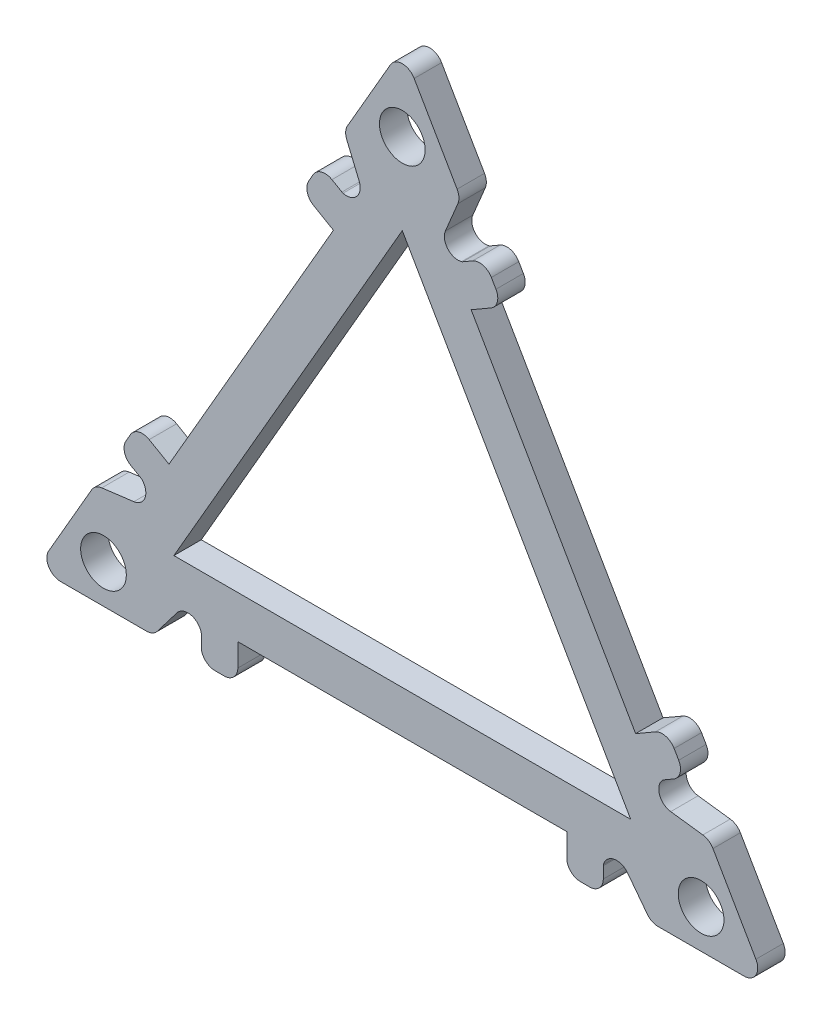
ISO-10303-21;
HEADER;
FILE_DESCRIPTION(('STEP AP214'),'2;1');
FILE_NAME('part.step','',(''),(''),'','','');
FILE_SCHEMA(('AUTOMOTIVE_DESIGN { 1 0 10303 214 1 1 1 1 }'));
ENDSEC;
DATA;
#1=APPLICATION_CONTEXT('core data for automotive mechanical design processes');
#2=APPLICATION_PROTOCOL_DEFINITION('international standard','automotive_design',2000,#1);
#3=PRODUCT_CONTEXT('',#1,'mechanical');
#4=PRODUCT('Part','Part','',(#3));
#5=PRODUCT_RELATED_PRODUCT_CATEGORY('part','',(#4));
#6=PRODUCT_DEFINITION_FORMATION('','',#4);
#7=PRODUCT_DEFINITION_CONTEXT('part definition',#1,'design');
#8=PRODUCT_DEFINITION('design','',#6,#7);
#9=PRODUCT_DEFINITION_SHAPE('','',#8);
#10=(LENGTH_UNIT() NAMED_UNIT(*) SI_UNIT(.MILLI.,.METRE.));
#11=(NAMED_UNIT(*) PLANE_ANGLE_UNIT() SI_UNIT($,.RADIAN.));
#12=(NAMED_UNIT(*) SI_UNIT($,.STERADIAN.) SOLID_ANGLE_UNIT());
#13=UNCERTAINTY_MEASURE_WITH_UNIT(LENGTH_MEASURE(1.E-05),#10,'distance_accuracy_value','');
#14=(GEOMETRIC_REPRESENTATION_CONTEXT(3) GLOBAL_UNCERTAINTY_ASSIGNED_CONTEXT((#13)) GLOBAL_UNIT_ASSIGNED_CONTEXT((#10,
#11,#12)) REPRESENTATION_CONTEXT('',''));
#15=CARTESIAN_POINT('',(0.,0.,0.));
#16=DIRECTION('',(0.,0.,1.));
#17=DIRECTION('',(1.,0.,0.));
#18=AXIS2_PLACEMENT_3D('',#15,#16,#17);
#19=CARTESIAN_POINT('',(-12.5,7.21687836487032,3.));
#20=DIRECTION('',(0.866025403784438,-0.5,0.));
#21=DIRECTION('',(0.5,0.866025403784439,0.));
#22=AXIS2_PLACEMENT_3D('',#19,#20,#21);
#23=PLANE('',#22);
#24=DIRECTION('',(-0.5,-0.866025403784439,0.));
#25=VECTOR('',#24,1.);
#26=CARTESIAN_POINT('',(-12.5,7.21687836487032,0.));
#27=LINE('',#26,#25);
#28=CARTESIAN_POINT('',(0.,28.8675134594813,0.));
#29=VERTEX_POINT('',#28);
#30=CARTESIAN_POINT('',(-25.,-14.4337567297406,0.));
#31=VERTEX_POINT('',#30);
#32=EDGE_CURVE('E473',#29,#31,#27,.T.);
#33=ORIENTED_EDGE('',*,*,#32,.F.);
#34=DIRECTION('',(0.,0.,-1.));
#35=VECTOR('',#34,1.);
#36=CARTESIAN_POINT('',(0.,28.8675134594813,3.));
#37=LINE('',#36,#35);
#38=CARTESIAN_POINT('',(0.,28.8675134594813,3.));
#39=VERTEX_POINT('',#38);
#40=EDGE_CURVE('E11',#39,#29,#37,.T.);
#41=ORIENTED_EDGE('',*,*,#40,.F.);
#42=DIRECTION('',(-0.5,-0.866025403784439,0.));
#43=VECTOR('',#42,1.);
#44=CARTESIAN_POINT('',(-12.5,7.21687836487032,3.));
#45=LINE('',#44,#43);
#46=CARTESIAN_POINT('',(-25.,-14.4337567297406,3.));
#47=VERTEX_POINT('',#46);
#48=EDGE_CURVE('E471',#39,#47,#45,.T.);
#49=ORIENTED_EDGE('',*,*,#48,.T.);
#50=DIRECTION('',(0.,0.,-1.));
#51=VECTOR('',#50,1.);
#52=CARTESIAN_POINT('',(-25.,-14.4337567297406,3.));
#53=LINE('',#52,#51);
#54=EDGE_CURVE('E54',#47,#31,#53,.T.);
#55=ORIENTED_EDGE('',*,*,#54,.T.);
#56=EDGE_LOOP('',(#33,#41,#49,#55));
#57=FACE_BOUND('',#56,.T.);
#58=ADVANCED_FACE('F35',(#57),#23,.T.);
#59=CARTESIAN_POINT('',(12.5,7.21687836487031,3.));
#60=DIRECTION('',(-0.866025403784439,-0.499999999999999,0.));
#61=DIRECTION('',(0.499999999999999,-0.866025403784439,0.));
#62=AXIS2_PLACEMENT_3D('',#59,#60,#61);
#63=PLANE('',#62);
#64=DIRECTION('',(-0.499999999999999,0.866025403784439,0.));
#65=VECTOR('',#64,1.);
#66=CARTESIAN_POINT('',(12.5,7.21687836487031,0.));
#67=LINE('',#66,#65);
#68=CARTESIAN_POINT('',(25.,-14.4337567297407,0.));
#69=VERTEX_POINT('',#68);
#70=EDGE_CURVE('E685',#69,#29,#67,.T.);
#71=ORIENTED_EDGE('',*,*,#70,.F.);
#72=DIRECTION('',(0.,0.,-1.));
#73=VECTOR('',#72,1.);
#74=CARTESIAN_POINT('',(25.,-14.4337567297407,3.));
#75=LINE('',#74,#73);
#76=CARTESIAN_POINT('',(25.,-14.4337567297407,3.));
#77=VERTEX_POINT('',#76);
#78=EDGE_CURVE('E45',#77,#69,#75,.T.);
#79=ORIENTED_EDGE('',*,*,#78,.F.);
#80=DIRECTION('',(-0.499999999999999,0.866025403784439,0.));
#81=VECTOR('',#80,1.);
#82=CARTESIAN_POINT('',(12.5,7.21687836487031,3.));
#83=LINE('',#82,#81);
#84=EDGE_CURVE('E481',#77,#39,#83,.T.);
#85=ORIENTED_EDGE('',*,*,#84,.T.);
#86=ORIENTED_EDGE('',*,*,#40,.T.);
#87=EDGE_LOOP('',(#71,#79,#85,#86));
#88=FACE_BOUND('',#87,.T.);
#89=ADVANCED_FACE('F485',(#88),#63,.T.);
#90=CARTESIAN_POINT('',(20.,11.5470053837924,3.));
#91=DIRECTION('',(-0.86602540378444,-0.499999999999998,0.));
#92=DIRECTION('',(0.499999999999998,-0.86602540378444,0.));
#93=AXIS2_PLACEMENT_3D('',#90,#91,#92);
#94=PLANE('',#93);
#95=DIRECTION('',(-0.499999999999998,0.86602540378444,0.));
#96=VECTOR('',#95,1.);
#97=CARTESIAN_POINT('',(20.,11.5470053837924,0.));
#98=LINE('',#97,#96);
#99=CARTESIAN_POINT('',(5.99999999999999,35.7957166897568,0.));
#100=VERTEX_POINT('',#99);
#101=CARTESIAN_POINT('',(1.29903810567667,43.9380215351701,0.));
#102=VERTEX_POINT('',#101);
#103=EDGE_CURVE('E500',#100,#102,#98,.T.);
#104=ORIENTED_EDGE('',*,*,#103,.T.);
#105=DIRECTION('',(0.,0.,-1.));
#106=VECTOR('',#105,1.);
#107=CARTESIAN_POINT('',(1.29903810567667,43.9380215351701,3.));
#108=LINE('',#107,#106);
#109=CARTESIAN_POINT('',(1.29903810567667,43.9380215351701,3.));
#110=VERTEX_POINT('',#109);
#111=EDGE_CURVE('E39',#110,#102,#108,.T.);
#112=ORIENTED_EDGE('',*,*,#111,.F.);
#113=DIRECTION('',(-0.499999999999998,0.86602540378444,0.));
#114=VECTOR('',#113,1.);
#115=CARTESIAN_POINT('',(20.,11.5470053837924,3.));
#116=LINE('',#115,#114);
#117=CARTESIAN_POINT('',(5.99999999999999,35.7957166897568,3.));
#118=VERTEX_POINT('',#117);
#119=EDGE_CURVE('E1022',#118,#110,#116,.T.);
#120=ORIENTED_EDGE('',*,*,#119,.F.);
#121=DIRECTION('',(0.,0.,-1.));
#122=VECTOR('',#121,1.);
#123=CARTESIAN_POINT('',(5.99999999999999,35.7957166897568,3.));
#124=LINE('',#123,#122);
#125=EDGE_CURVE('E496',#118,#100,#124,.T.);
#126=ORIENTED_EDGE('',*,*,#125,.T.);
#127=EDGE_LOOP('',(#104,#112,#120,#126));
#128=FACE_BOUND('',#127,.T.);
#129=ADVANCED_FACE('F848',(#128),#94,.F.);
#130=CARTESIAN_POINT('',(0.,43.1880215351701,3.));
#131=DIRECTION('',(0.,0.,-1.));
#132=DIRECTION('',(-1.,0.,0.));
#133=AXIS2_PLACEMENT_3D('',#130,#131,#132);
#134=CYLINDRICAL_SURFACE('',#133,1.5);
#135=CARTESIAN_POINT('',(0.,43.1880215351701,0.));
#136=DIRECTION('',(0.,0.,1.));
#137=DIRECTION('',(1.,0.,0.));
#138=AXIS2_PLACEMENT_3D('',#135,#136,#137);
#139=CIRCLE('',#138,1.5);
#140=CARTESIAN_POINT('',(-1.29903810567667,43.9380215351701,0.));
#141=VERTEX_POINT('',#140);
#142=EDGE_CURVE('E503',#102,#141,#139,.T.);
#143=ORIENTED_EDGE('',*,*,#142,.T.);
#144=DIRECTION('',(0.,0.,-1.));
#145=VECTOR('',#144,1.);
#146=CARTESIAN_POINT('',(-1.29903810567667,43.9380215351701,3.));
#147=LINE('',#146,#145);
#148=CARTESIAN_POINT('',(-1.29903810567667,43.9380215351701,3.));
#149=VERTEX_POINT('',#148);
#150=EDGE_CURVE('E838',#149,#141,#147,.T.);
#151=ORIENTED_EDGE('',*,*,#150,.F.);
#152=CARTESIAN_POINT('',(0.,43.1880215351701,3.));
#153=DIRECTION('',(0.,0.,1.));
#154=DIRECTION('',(1.,0.,0.));
#155=AXIS2_PLACEMENT_3D('',#152,#153,#154);
#156=CIRCLE('',#155,1.5);
#157=EDGE_CURVE('E274',#110,#149,#156,.T.);
#158=ORIENTED_EDGE('',*,*,#157,.F.);
#159=ORIENTED_EDGE('',*,*,#111,.T.);
#160=EDGE_LOOP('',(#143,#151,#158,#159));
#161=FACE_BOUND('',#160,.T.);
#162=ADVANCED_FACE('F844',(#161),#134,.T.);
#163=CARTESIAN_POINT('',(-19.9999999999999,11.5470053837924,3.));
#164=DIRECTION('',(0.86602540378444,-0.499999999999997,0.));
#165=DIRECTION('',(0.499999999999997,0.866025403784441,0.));
#166=AXIS2_PLACEMENT_3D('',#163,#164,#165);
#167=PLANE('',#166);
#168=DIRECTION('',(-0.499999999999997,-0.866025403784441,0.));
#169=VECTOR('',#168,1.);
#170=CARTESIAN_POINT('',(-19.9999999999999,11.5470053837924,0.));
#171=LINE('',#170,#169);
#172=CARTESIAN_POINT('',(-5.99999999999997,35.7957166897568,0.));
#173=VERTEX_POINT('',#172);
#174=EDGE_CURVE('E505',#141,#173,#171,.T.);
#175=ORIENTED_EDGE('',*,*,#174,.T.);
#176=DIRECTION('',(0.,0.,-1.));
#177=VECTOR('',#176,1.);
#178=CARTESIAN_POINT('',(-5.99999999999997,35.7957166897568,3.));
#179=LINE('',#178,#177);
#180=CARTESIAN_POINT('',(-5.99999999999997,35.7957166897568,3.));
#181=VERTEX_POINT('',#180);
#182=EDGE_CURVE('E837',#181,#173,#179,.T.);
#183=ORIENTED_EDGE('',*,*,#182,.F.);
#184=DIRECTION('',(-0.499999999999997,-0.866025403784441,0.));
#185=VECTOR('',#184,1.);
#186=CARTESIAN_POINT('',(-19.9999999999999,11.5470053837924,3.));
#187=LINE('',#186,#185);
#188=EDGE_CURVE('E860',#149,#181,#187,.T.);
#189=ORIENTED_EDGE('',*,*,#188,.F.);
#190=ORIENTED_EDGE('',*,*,#150,.T.);
#191=EDGE_LOOP('',(#175,#183,#189,#190));
#192=FACE_BOUND('',#191,.T.);
#193=ADVANCED_FACE('F858',(#192),#167,.F.);
#194=CARTESIAN_POINT('',(-4.70096189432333,35.0457166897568,3.));
#195=DIRECTION('',(0.,0.,-1.));
#196=DIRECTION('',(-1.,0.,0.));
#197=AXIS2_PLACEMENT_3D('',#194,#195,#196);
#198=CYLINDRICAL_SURFACE('',#197,1.49999999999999);
#199=CARTESIAN_POINT('',(-4.70096189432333,35.0457166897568,0.));
#200=DIRECTION('',(0.,0.,1.));
#201=DIRECTION('',(1.,0.,0.));
#202=AXIS2_PLACEMENT_3D('',#199,#200,#201);
#203=CIRCLE('',#202,1.49999999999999);
#204=CARTESIAN_POINT('',(-6.08498388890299,34.4673715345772,0.));
#205=VERTEX_POINT('',#204);
#206=EDGE_CURVE('E508',#205,#173,#203,.F.);
#207=ORIENTED_EDGE('',*,*,#206,.F.);
#208=DIRECTION('',(0.,0.,-1.));
#209=VECTOR('',#208,1.);
#210=CARTESIAN_POINT('',(-6.08498388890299,34.4673715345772,3.));
#211=LINE('',#210,#209);
#212=CARTESIAN_POINT('',(-6.08498388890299,34.4673715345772,3.));
#213=VERTEX_POINT('',#212);
#214=EDGE_CURVE('E835',#213,#205,#211,.T.);
#215=ORIENTED_EDGE('',*,*,#214,.F.);
#216=CARTESIAN_POINT('',(-4.70096189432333,35.0457166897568,3.));
#217=DIRECTION('',(0.,0.,1.));
#218=DIRECTION('',(1.,0.,0.));
#219=AXIS2_PLACEMENT_3D('',#216,#217,#218);
#220=CIRCLE('',#219,1.49999999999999);
#221=EDGE_CURVE('E863',#213,#181,#220,.F.);
#222=ORIENTED_EDGE('',*,*,#221,.T.);
#223=ORIENTED_EDGE('',*,*,#182,.T.);
#224=EDGE_LOOP('',(#207,#215,#222,#223));
#225=FACE_BOUND('',#224,.T.);
#226=ADVANCED_FACE('F864',(#225),#198,.T.);
#227=CARTESIAN_POINT('',(7.08144744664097,2.95914431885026,3.));
#228=DIRECTION('',(0.922681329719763,0.385563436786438,0.));
#229=DIRECTION('',(-0.385563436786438,0.922681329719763,0.));
#230=AXIS2_PLACEMENT_3D('',#227,#228,#229);
#231=PLANE('',#230);
#232=DIRECTION('',(0.385563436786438,-0.922681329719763,0.));
#233=VECTOR('',#232,1.);
#234=CARTESIAN_POINT('',(7.08144744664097,2.95914431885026,0.));
#235=LINE('',#234,#233);
#236=CARTESIAN_POINT('',(-4.7183090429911,31.1968192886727,0.));
#237=VERTEX_POINT('',#236);
#238=EDGE_CURVE('E511',#205,#237,#235,.T.);
#239=ORIENTED_EDGE('',*,*,#238,.T.);
#240=DIRECTION('',(0.,0.,-1.));
#241=VECTOR('',#240,1.);
#242=CARTESIAN_POINT('',(-4.7183090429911,31.1968192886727,3.));
#243=LINE('',#242,#241);
#244=CARTESIAN_POINT('',(-4.7183090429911,31.1968192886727,3.));
#245=VERTEX_POINT('',#244);
#246=EDGE_CURVE('E833',#245,#237,#243,.T.);
#247=ORIENTED_EDGE('',*,*,#246,.F.);
#248=DIRECTION('',(0.385563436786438,-0.922681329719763,0.));
#249=VECTOR('',#248,1.);
#250=CARTESIAN_POINT('',(7.08144744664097,2.95914431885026,3.));
#251=LINE('',#250,#249);
#252=EDGE_CURVE('E867',#213,#245,#251,.T.);
#253=ORIENTED_EDGE('',*,*,#252,.F.);
#254=ORIENTED_EDGE('',*,*,#214,.T.);
#255=EDGE_LOOP('',(#239,#247,#253,#254));
#256=FACE_BOUND('',#255,.T.);
#257=ADVANCED_FACE('F1294',(#256),#231,.F.);
#258=CARTESIAN_POINT('',(-6.10233103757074,30.618474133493,3.));
#259=DIRECTION('',(0.,0.,-1.));
#260=DIRECTION('',(-1.,0.,0.));
#261=AXIS2_PLACEMENT_3D('',#258,#259,#260);
#262=CYLINDRICAL_SURFACE('',#261,1.5);
#263=CARTESIAN_POINT('',(-6.10233103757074,30.618474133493,0.));
#264=DIRECTION('',(0.,0.,1.));
#265=DIRECTION('',(1.,0.,0.));
#266=AXIS2_PLACEMENT_3D('',#263,#264,#265);
#267=CIRCLE('',#266,1.5);
#268=CARTESIAN_POINT('',(-6.48657637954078,29.168523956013,0.));
#269=VERTEX_POINT('',#268);
#270=EDGE_CURVE('E514',#269,#237,#267,.T.);
#271=ORIENTED_EDGE('',*,*,#270,.F.);
#272=DIRECTION('',(0.,0.,-1.));
#273=VECTOR('',#272,1.);
#274=CARTESIAN_POINT('',(-6.48657637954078,29.168523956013,3.));
#275=LINE('',#274,#273);
#276=CARTESIAN_POINT('',(-6.48657637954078,29.168523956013,3.));
#277=VERTEX_POINT('',#276);
#278=EDGE_CURVE('E831',#277,#269,#275,.T.);
#279=ORIENTED_EDGE('',*,*,#278,.F.);
#280=CARTESIAN_POINT('',(-6.10233103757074,30.618474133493,3.));
#281=DIRECTION('',(0.,0.,1.));
#282=DIRECTION('',(1.,0.,0.));
#283=AXIS2_PLACEMENT_3D('',#280,#281,#282);
#284=CIRCLE('',#283,1.5);
#285=EDGE_CURVE('E869',#277,#245,#284,.T.);
#286=ORIENTED_EDGE('',*,*,#285,.T.);
#287=ORIENTED_EDGE('',*,*,#246,.T.);
#288=EDGE_LOOP('',(#271,#279,#286,#287));
#289=FACE_BOUND('',#288,.T.);
#290=ADVANCED_FACE('F1290',(#289),#262,.F.);
#291=CARTESIAN_POINT('',(-6.3584945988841,29.6518406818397,3.));
#292=DIRECTION('',(0.,0.,-1.));
#293=DIRECTION('',(-1.,0.,0.));
#294=AXIS2_PLACEMENT_3D('',#291,#292,#293);
#295=CYLINDRICAL_SURFACE('',#294,0.499999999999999);
#296=CARTESIAN_POINT('',(-6.3584945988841,29.6518406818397,0.));
#297=DIRECTION('',(0.,0.,1.));
#298=DIRECTION('',(1.,0.,0.));
#299=AXIS2_PLACEMENT_3D('',#296,#297,#298);
#300=CIRCLE('',#299,0.499999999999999);
#301=CARTESIAN_POINT('',(-6.6084945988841,29.2188279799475,0.));
#302=VERTEX_POINT('',#301);
#303=EDGE_CURVE('E517',#302,#269,#300,.T.);
#304=ORIENTED_EDGE('',*,*,#303,.F.);
#305=DIRECTION('',(0.,0.,-1.));
#306=VECTOR('',#305,1.);
#307=CARTESIAN_POINT('',(-6.6084945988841,29.2188279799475,3.));
#308=LINE('',#307,#306);
#309=CARTESIAN_POINT('',(-6.6084945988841,29.2188279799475,3.));
#310=VERTEX_POINT('',#309);
#311=EDGE_CURVE('E829',#310,#302,#308,.T.);
#312=ORIENTED_EDGE('',*,*,#311,.F.);
#313=CARTESIAN_POINT('',(-6.3584945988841,29.6518406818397,3.));
#314=DIRECTION('',(0.,0.,1.));
#315=DIRECTION('',(1.,0.,0.));
#316=AXIS2_PLACEMENT_3D('',#313,#314,#315);
#317=CIRCLE('',#316,0.499999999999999);
#318=EDGE_CURVE('E876',#310,#277,#317,.T.);
#319=ORIENTED_EDGE('',*,*,#318,.T.);
#320=ORIENTED_EDGE('',*,*,#278,.T.);
#321=EDGE_LOOP('',(#304,#312,#319,#320));
#322=FACE_BOUND('',#321,.T.);
#323=ADVANCED_FACE('F1286',(#322),#295,.F.);
#324=CARTESIAN_POINT('',(11.,19.0525588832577,3.));
#325=DIRECTION('',(-0.499999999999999,-0.866025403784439,0.));
#326=DIRECTION('',(0.866025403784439,-0.499999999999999,0.));
#327=AXIS2_PLACEMENT_3D('',#324,#325,#326);
#328=PLANE('',#327);
#329=DIRECTION('',(-0.866025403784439,0.5,0.));
#330=VECTOR('',#329,1.);
#331=CARTESIAN_POINT('',(11.,19.0525588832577,0.));
#332=LINE('',#331,#330);
#333=CARTESIAN_POINT('',(-7.70096189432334,29.8495642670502,0.));
#334=VERTEX_POINT('',#333);
#335=EDGE_CURVE('E520',#302,#334,#332,.T.);
#336=ORIENTED_EDGE('',*,*,#335,.T.);
#337=DIRECTION('',(0.,0.,-1.));
#338=VECTOR('',#337,1.);
#339=CARTESIAN_POINT('',(-7.70096189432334,29.8495642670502,3.));
#340=LINE('',#339,#338);
#341=CARTESIAN_POINT('',(-7.70096189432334,29.8495642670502,3.));
#342=VERTEX_POINT('',#341);
#343=EDGE_CURVE('E827',#342,#334,#340,.T.);
#344=ORIENTED_EDGE('',*,*,#343,.F.);
#345=DIRECTION('',(-0.866025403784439,0.5,0.));
#346=VECTOR('',#345,1.);
#347=CARTESIAN_POINT('',(11.,19.0525588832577,3.));
#348=LINE('',#347,#346);
#349=EDGE_CURVE('E879',#310,#342,#348,.T.);
#350=ORIENTED_EDGE('',*,*,#349,.F.);
#351=ORIENTED_EDGE('',*,*,#311,.T.);
#352=EDGE_LOOP('',(#336,#344,#350,#351));
#353=FACE_BOUND('',#352,.T.);
#354=ADVANCED_FACE('F1282',(#353),#328,.F.);
#355=CARTESIAN_POINT('',(-8.45096189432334,28.5505261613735,3.));
#356=DIRECTION('',(0.,0.,-1.));
#357=DIRECTION('',(-1.,0.,0.));
#358=AXIS2_PLACEMENT_3D('',#355,#356,#357);
#359=CYLINDRICAL_SURFACE('',#358,1.49999999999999);
#360=CARTESIAN_POINT('',(-8.45096189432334,28.5505261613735,0.));
#361=DIRECTION('',(0.,0.,1.));
#362=DIRECTION('',(1.,0.,0.));
#363=AXIS2_PLACEMENT_3D('',#360,#361,#362);
#364=CIRCLE('',#363,1.49999999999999);
#365=CARTESIAN_POINT('',(-9.74999999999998,29.3005261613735,0.));
#366=VERTEX_POINT('',#365);
#367=EDGE_CURVE('E523',#366,#334,#364,.F.);
#368=ORIENTED_EDGE('',*,*,#367,.F.);
#369=DIRECTION('',(0.,0.,-1.));
#370=VECTOR('',#369,1.);
#371=CARTESIAN_POINT('',(-9.74999999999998,29.3005261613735,3.));
#372=LINE('',#371,#370);
#373=CARTESIAN_POINT('',(-9.74999999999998,29.3005261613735,3.));
#374=VERTEX_POINT('',#373);
#375=EDGE_CURVE('E825',#374,#366,#372,.T.);
#376=ORIENTED_EDGE('',*,*,#375,.F.);
#377=CARTESIAN_POINT('',(-8.45096189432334,28.5505261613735,3.));
#378=DIRECTION('',(0.,0.,1.));
#379=DIRECTION('',(1.,0.,0.));
#380=AXIS2_PLACEMENT_3D('',#377,#378,#379);
#381=CIRCLE('',#380,1.49999999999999);
#382=EDGE_CURVE('E881',#374,#342,#381,.F.);
#383=ORIENTED_EDGE('',*,*,#382,.T.);
#384=ORIENTED_EDGE('',*,*,#343,.T.);
#385=EDGE_LOOP('',(#368,#376,#383,#384));
#386=FACE_BOUND('',#385,.T.);
#387=ADVANCED_FACE('F1278',(#386),#359,.T.);
#388=CARTESIAN_POINT('',(-19.9999999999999,11.5470053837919,3.));
#389=DIRECTION('',(0.866025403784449,-0.499999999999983,0.));
#390=DIRECTION('',(0.499999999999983,0.866025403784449,0.));
#391=AXIS2_PLACEMENT_3D('',#388,#389,#390);
#392=PLANE('',#391);
#393=DIRECTION('',(-0.499999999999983,-0.866025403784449,0.));
#394=VECTOR('',#393,1.);
#395=CARTESIAN_POINT('',(-19.9999999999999,11.5470053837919,0.));
#396=LINE('',#395,#394);
#397=CARTESIAN_POINT('',(-10.25,28.4345007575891,0.));
#398=VERTEX_POINT('',#397);
#399=EDGE_CURVE('E526',#366,#398,#396,.T.);
#400=ORIENTED_EDGE('',*,*,#399,.T.);
#401=DIRECTION('',(0.,0.,-1.));
#402=VECTOR('',#401,1.);
#403=CARTESIAN_POINT('',(-10.25,28.4345007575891,3.));
#404=LINE('',#403,#402);
#405=CARTESIAN_POINT('',(-10.25,28.4345007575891,3.));
#406=VERTEX_POINT('',#405);
#407=EDGE_CURVE('E823',#406,#398,#404,.T.);
#408=ORIENTED_EDGE('',*,*,#407,.F.);
#409=DIRECTION('',(-0.499999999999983,-0.866025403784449,0.));
#410=VECTOR('',#409,1.);
#411=CARTESIAN_POINT('',(-19.9999999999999,11.5470053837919,3.));
#412=LINE('',#411,#410);
#413=EDGE_CURVE('E884',#374,#406,#412,.T.);
#414=ORIENTED_EDGE('',*,*,#413,.F.);
#415=ORIENTED_EDGE('',*,*,#375,.T.);
#416=EDGE_LOOP('',(#400,#408,#414,#415));
#417=FACE_BOUND('',#416,.T.);
#418=ADVANCED_FACE('F1274',(#417),#392,.F.);
#419=CARTESIAN_POINT('',(-8.95096189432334,27.6845007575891,3.));
#420=DIRECTION('',(0.,0.,-1.));
#421=DIRECTION('',(-1.,0.,0.));
#422=AXIS2_PLACEMENT_3D('',#419,#420,#421);
#423=CYLINDRICAL_SURFACE('',#422,1.49999999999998);
#424=CARTESIAN_POINT('',(-8.95096189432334,27.6845007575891,0.));
#425=DIRECTION('',(0.,0.,1.));
#426=DIRECTION('',(1.,0.,0.));
#427=AXIS2_PLACEMENT_3D('',#424,#425,#426);
#428=CIRCLE('',#427,1.49999999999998);
#429=CARTESIAN_POINT('',(-9.70096189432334,26.3854626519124,0.));
#430=VERTEX_POINT('',#429);
#431=EDGE_CURVE('E529',#430,#398,#428,.F.);
#432=ORIENTED_EDGE('',*,*,#431,.F.);
#433=DIRECTION('',(0.,0.,-1.));
#434=VECTOR('',#433,1.);
#435=CARTESIAN_POINT('',(-9.70096189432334,26.3854626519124,3.));
#436=LINE('',#435,#434);
#437=CARTESIAN_POINT('',(-9.70096189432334,26.3854626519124,3.));
#438=VERTEX_POINT('',#437);
#439=EDGE_CURVE('E821',#438,#430,#436,.T.);
#440=ORIENTED_EDGE('',*,*,#439,.F.);
#441=CARTESIAN_POINT('',(-8.95096189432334,27.6845007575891,3.));
#442=DIRECTION('',(0.,0.,1.));
#443=DIRECTION('',(1.,0.,0.));
#444=AXIS2_PLACEMENT_3D('',#441,#442,#443);
#445=CIRCLE('',#444,1.49999999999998);
#446=EDGE_CURVE('E886',#438,#406,#445,.F.);
#447=ORIENTED_EDGE('',*,*,#446,.T.);
#448=ORIENTED_EDGE('',*,*,#407,.T.);
#449=EDGE_LOOP('',(#432,#440,#447,#448));
#450=FACE_BOUND('',#449,.T.);
#451=ADVANCED_FACE('F1270',(#450),#423,.T.);
#452=CARTESIAN_POINT('',(9.00000000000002,15.5884572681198,3.));
#453=DIRECTION('',(-0.500000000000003,-0.866025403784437,0.));
#454=DIRECTION('',(0.866025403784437,-0.500000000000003,0.));
#455=AXIS2_PLACEMENT_3D('',#452,#453,#454);
#456=PLANE('',#455);
#457=DIRECTION('',(-0.866025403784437,0.500000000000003,0.));
#458=VECTOR('',#457,1.);
#459=CARTESIAN_POINT('',(9.00000000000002,15.5884572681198,0.));
#460=LINE('',#459,#458);
#461=CARTESIAN_POINT('',(-7.53589838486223,25.1354626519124,0.));
#462=VERTEX_POINT('',#461);
#463=EDGE_CURVE('E532',#462,#430,#460,.T.);
#464=ORIENTED_EDGE('',*,*,#463,.F.);
#465=DIRECTION('',(0.,0.,-1.));
#466=VECTOR('',#465,1.);
#467=CARTESIAN_POINT('',(-7.53589838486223,25.1354626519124,3.));
#468=LINE('',#467,#466);
#469=CARTESIAN_POINT('',(-7.53589838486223,25.1354626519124,3.));
#470=VERTEX_POINT('',#469);
#471=EDGE_CURVE('E819',#470,#462,#468,.T.);
#472=ORIENTED_EDGE('',*,*,#471,.F.);
#473=DIRECTION('',(-0.866025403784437,0.500000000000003,0.));
#474=VECTOR('',#473,1.);
#475=CARTESIAN_POINT('',(9.00000000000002,15.5884572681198,3.));
#476=LINE('',#475,#474);
#477=EDGE_CURVE('E889',#470,#438,#476,.T.);
#478=ORIENTED_EDGE('',*,*,#477,.T.);
#479=ORIENTED_EDGE('',*,*,#439,.T.);
#480=EDGE_LOOP('',(#464,#472,#478,#479));
#481=FACE_BOUND('',#480,.T.);
#482=ADVANCED_FACE('F1266',(#481),#456,.T.);
#483=CARTESIAN_POINT('',(-16.5358983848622,9.54700538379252,3.));
#484=DIRECTION('',(0.866025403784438,-0.5,0.));
#485=DIRECTION('',(0.5,0.866025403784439,0.));
#486=AXIS2_PLACEMENT_3D('',#483,#484,#485);
#487=PLANE('',#486);
#488=DIRECTION('',(-0.5,-0.866025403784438,0.));
#489=VECTOR('',#488,1.);
#490=CARTESIAN_POINT('',(-16.5358983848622,9.54700538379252,0.));
#491=LINE('',#490,#489);
#492=CARTESIAN_POINT('',(-25.5358983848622,-6.04145188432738,0.));
#493=VERTEX_POINT('',#492);
#494=EDGE_CURVE('E535',#462,#493,#491,.T.);
#495=ORIENTED_EDGE('',*,*,#494,.T.);
#496=DIRECTION('',(0.,0.,-1.));
#497=VECTOR('',#496,1.);
#498=CARTESIAN_POINT('',(-25.5358983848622,-6.04145188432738,3.));
#499=LINE('',#498,#497);
#500=CARTESIAN_POINT('',(-25.5358983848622,-6.04145188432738,3.));
#501=VERTEX_POINT('',#500);
#502=EDGE_CURVE('E816',#501,#493,#499,.T.);
#503=ORIENTED_EDGE('',*,*,#502,.F.);
#504=DIRECTION('',(-0.5,-0.866025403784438,0.));
#505=VECTOR('',#504,1.);
#506=CARTESIAN_POINT('',(-16.5358983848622,9.54700538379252,3.));
#507=LINE('',#506,#505);
#508=EDGE_CURVE('E892',#470,#501,#507,.T.);
#509=ORIENTED_EDGE('',*,*,#508,.F.);
#510=ORIENTED_EDGE('',*,*,#471,.T.);
#511=EDGE_LOOP('',(#495,#503,#509,#510));
#512=FACE_BOUND('',#511,.T.);
#513=ADVANCED_FACE('F1262',(#512),#487,.F.);
#514=CARTESIAN_POINT('',(-8.99999999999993,-15.5884572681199,3.));
#515=DIRECTION('',(-0.499999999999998,-0.86602540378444,0.));
#516=DIRECTION('',(0.86602540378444,-0.499999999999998,0.));
#517=AXIS2_PLACEMENT_3D('',#514,#515,#516);
#518=PLANE('',#517);
#519=DIRECTION('',(-0.86602540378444,0.499999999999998,0.));
#520=VECTOR('',#519,1.);
#521=CARTESIAN_POINT('',(-8.99999999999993,-15.5884572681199,0.));
#522=LINE('',#521,#520);
#523=CARTESIAN_POINT('',(-27.7009618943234,-4.79145188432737,0.));
#524=VERTEX_POINT('',#523);
#525=EDGE_CURVE('E537',#493,#524,#522,.T.);
#526=ORIENTED_EDGE('',*,*,#525,.T.);
#527=DIRECTION('',(0.,0.,-1.));
#528=VECTOR('',#527,1.);
#529=CARTESIAN_POINT('',(-27.7009618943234,-4.79145188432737,3.));
#530=LINE('',#529,#528);
#531=CARTESIAN_POINT('',(-27.7009618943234,-4.79145188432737,3.));
#532=VERTEX_POINT('',#531);
#533=EDGE_CURVE('E813',#532,#524,#530,.T.);
#534=ORIENTED_EDGE('',*,*,#533,.F.);
#535=DIRECTION('',(-0.86602540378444,0.499999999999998,0.));
#536=VECTOR('',#535,1.);
#537=CARTESIAN_POINT('',(-8.99999999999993,-15.5884572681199,3.));
#538=LINE('',#537,#536);
#539=EDGE_CURVE('E894',#501,#532,#538,.T.);
#540=ORIENTED_EDGE('',*,*,#539,.F.);
#541=ORIENTED_EDGE('',*,*,#502,.T.);
#542=EDGE_LOOP('',(#526,#534,#540,#541));
#543=FACE_BOUND('',#542,.T.);
#544=ADVANCED_FACE('F1258',(#543),#518,.F.);
#545=CARTESIAN_POINT('',(-28.4509618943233,-6.09048999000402,3.));
#546=DIRECTION('',(0.,0.,-1.));
#547=DIRECTION('',(-1.,0.,0.));
#548=AXIS2_PLACEMENT_3D('',#545,#546,#547);
#549=CYLINDRICAL_SURFACE('',#548,1.49999999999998);
#550=CARTESIAN_POINT('',(-28.4509618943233,-6.09048999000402,0.));
#551=DIRECTION('',(0.,0.,1.));
#552=DIRECTION('',(1.,0.,0.));
#553=AXIS2_PLACEMENT_3D('',#550,#551,#552);
#554=CIRCLE('',#553,1.49999999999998);
#555=CARTESIAN_POINT('',(-29.75,-5.34048999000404,0.));
#556=VERTEX_POINT('',#555);
#557=EDGE_CURVE('E539',#524,#556,#554,.T.);
#558=ORIENTED_EDGE('',*,*,#557,.T.);
#559=DIRECTION('',(0.,0.,-1.));
#560=VECTOR('',#559,1.);
#561=CARTESIAN_POINT('',(-29.75,-5.34048999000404,3.));
#562=LINE('',#561,#560);
#563=CARTESIAN_POINT('',(-29.75,-5.34048999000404,3.));
#564=VERTEX_POINT('',#563);
#565=EDGE_CURVE('E811',#564,#556,#562,.T.);
#566=ORIENTED_EDGE('',*,*,#565,.F.);
#567=CARTESIAN_POINT('',(-28.4509618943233,-6.09048999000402,3.));
#568=DIRECTION('',(0.,0.,1.));
#569=DIRECTION('',(1.,0.,0.));
#570=AXIS2_PLACEMENT_3D('',#567,#568,#569);
#571=CIRCLE('',#570,1.49999999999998);
#572=EDGE_CURVE('E896',#532,#564,#571,.T.);
#573=ORIENTED_EDGE('',*,*,#572,.F.);
#574=ORIENTED_EDGE('',*,*,#533,.T.);
#575=EDGE_LOOP('',(#558,#566,#573,#574));
#576=FACE_BOUND('',#575,.T.);
#577=ADVANCED_FACE('F1254',(#576),#549,.T.);
#578=CARTESIAN_POINT('',(-19.9999999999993,11.5470053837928,3.));
#579=DIRECTION('',(-0.866025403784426,0.500000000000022,0.));
#580=DIRECTION('',(-0.500000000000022,-0.866025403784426,0.));
#581=AXIS2_PLACEMENT_3D('',#578,#579,#580);
#582=PLANE('',#581);
#583=DIRECTION('',(0.500000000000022,0.866025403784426,0.));
#584=VECTOR('',#583,1.);
#585=CARTESIAN_POINT('',(-19.9999999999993,11.5470053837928,0.));
#586=LINE('',#585,#584);
#587=CARTESIAN_POINT('',(-30.25,-6.20651539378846,0.));
#588=VERTEX_POINT('',#587);
#589=EDGE_CURVE('E542',#588,#556,#586,.T.);
#590=ORIENTED_EDGE('',*,*,#589,.F.);
#591=DIRECTION('',(0.,0.,-1.));
#592=VECTOR('',#591,1.);
#593=CARTESIAN_POINT('',(-30.25,-6.20651539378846,3.));
#594=LINE('',#593,#592);
#595=CARTESIAN_POINT('',(-30.25,-6.20651539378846,3.));
#596=VERTEX_POINT('',#595);
#597=EDGE_CURVE('E809',#596,#588,#594,.T.);
#598=ORIENTED_EDGE('',*,*,#597,.F.);
#599=DIRECTION('',(0.500000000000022,0.866025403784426,0.));
#600=VECTOR('',#599,1.);
#601=CARTESIAN_POINT('',(-19.9999999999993,11.5470053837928,3.));
#602=LINE('',#601,#600);
#603=EDGE_CURVE('E898',#596,#564,#602,.T.);
#604=ORIENTED_EDGE('',*,*,#603,.T.);
#605=ORIENTED_EDGE('',*,*,#565,.T.);
#606=EDGE_LOOP('',(#590,#598,#604,#605));
#607=FACE_BOUND('',#606,.T.);
#608=ADVANCED_FACE('F1250',(#607),#582,.T.);
#609=CARTESIAN_POINT('',(-28.9509618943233,-6.95651539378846,3.));
#610=DIRECTION('',(0.,0.,-1.));
#611=DIRECTION('',(-1.,0.,0.));
#612=AXIS2_PLACEMENT_3D('',#609,#610,#611);
#613=CYLINDRICAL_SURFACE('',#612,1.5);
#614=CARTESIAN_POINT('',(-28.9509618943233,-6.95651539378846,0.));
#615=DIRECTION('',(0.,0.,1.));
#616=DIRECTION('',(1.,0.,0.));
#617=AXIS2_PLACEMENT_3D('',#614,#615,#616);
#618=CIRCLE('',#617,1.5);
#619=CARTESIAN_POINT('',(-29.7009618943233,-8.25555349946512,0.));
#620=VERTEX_POINT('',#619);
#621=EDGE_CURVE('E545',#588,#620,#618,.T.);
#622=ORIENTED_EDGE('',*,*,#621,.T.);
#623=DIRECTION('',(0.,0.,-1.));
#624=VECTOR('',#623,1.);
#625=CARTESIAN_POINT('',(-29.7009618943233,-8.25555349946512,3.));
#626=LINE('',#625,#624);
#627=CARTESIAN_POINT('',(-29.7009618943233,-8.25555349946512,3.));
#628=VERTEX_POINT('',#627);
#629=EDGE_CURVE('E807',#628,#620,#626,.T.);
#630=ORIENTED_EDGE('',*,*,#629,.F.);
#631=CARTESIAN_POINT('',(-28.9509618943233,-6.95651539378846,3.));
#632=DIRECTION('',(0.,0.,1.));
#633=DIRECTION('',(1.,0.,0.));
#634=AXIS2_PLACEMENT_3D('',#631,#632,#633);
#635=CIRCLE('',#634,1.5);
#636=EDGE_CURVE('E901',#596,#628,#635,.T.);
#637=ORIENTED_EDGE('',*,*,#636,.F.);
#638=ORIENTED_EDGE('',*,*,#597,.T.);
#639=EDGE_LOOP('',(#622,#630,#637,#638));
#640=FACE_BOUND('',#639,.T.);
#641=ADVANCED_FACE('F1246',(#640),#613,.T.);
#642=CARTESIAN_POINT('',(-11.0000000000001,-19.0525588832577,3.));
#643=DIRECTION('',(-0.500000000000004,-0.866025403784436,0.));
#644=DIRECTION('',(0.866025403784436,-0.500000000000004,0.));
#645=AXIS2_PLACEMENT_3D('',#642,#643,#644);
#646=PLANE('',#645);
#647=DIRECTION('',(-0.866025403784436,0.500000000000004,0.));
#648=VECTOR('',#647,1.);
#649=CARTESIAN_POINT('',(-11.0000000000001,-19.0525588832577,0.));
#650=LINE('',#649,#648);
#651=CARTESIAN_POINT('',(-28.6084945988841,-8.88628978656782,0.));
#652=VERTEX_POINT('',#651);
#653=EDGE_CURVE('E548',#652,#620,#650,.T.);
#654=ORIENTED_EDGE('',*,*,#653,.F.);
#655=DIRECTION('',(0.,0.,-1.));
#656=VECTOR('',#655,1.);
#657=CARTESIAN_POINT('',(-28.6084945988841,-8.88628978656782,3.));
#658=LINE('',#657,#656);
#659=CARTESIAN_POINT('',(-28.6084945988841,-8.88628978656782,3.));
#660=VERTEX_POINT('',#659);
#661=EDGE_CURVE('E805',#660,#652,#658,.T.);
#662=ORIENTED_EDGE('',*,*,#661,.F.);
#663=DIRECTION('',(-0.866025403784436,0.500000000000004,0.));
#664=VECTOR('',#663,1.);
#665=CARTESIAN_POINT('',(-11.0000000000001,-19.0525588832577,3.));
#666=LINE('',#665,#664);
#667=EDGE_CURVE('E903',#660,#628,#666,.T.);
#668=ORIENTED_EDGE('',*,*,#667,.T.);
#669=ORIENTED_EDGE('',*,*,#629,.T.);
#670=EDGE_LOOP('',(#654,#662,#668,#669));
#671=FACE_BOUND('',#670,.T.);
#672=ADVANCED_FACE('F1242',(#671),#646,.T.);
#673=CARTESIAN_POINT('',(-28.8584945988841,-9.31930248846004,3.));
#674=DIRECTION('',(0.,0.,-1.));
#675=DIRECTION('',(-1.,0.,0.));
#676=AXIS2_PLACEMENT_3D('',#673,#674,#675);
#677=CYLINDRICAL_SURFACE('',#676,0.500000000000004);
#678=CARTESIAN_POINT('',(-28.8584945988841,-9.31930248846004,0.));
#679=DIRECTION('',(0.,0.,1.));
#680=DIRECTION('',(1.,0.,0.));
#681=AXIS2_PLACEMENT_3D('',#678,#679,#680);
#682=CIRCLE('',#681,0.500000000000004);
#683=CARTESIAN_POINT('',(-28.5039709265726,-8.96672204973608,0.));
#684=VERTEX_POINT('',#683);
#685=EDGE_CURVE('E551',#652,#684,#682,.F.);
#686=ORIENTED_EDGE('',*,*,#685,.T.);
#687=DIRECTION('',(0.,0.,-1.));
#688=VECTOR('',#687,1.);
#689=CARTESIAN_POINT('',(-28.5039709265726,-8.96672204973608,3.));
#690=LINE('',#689,#688);
#691=CARTESIAN_POINT('',(-28.5039709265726,-8.96672204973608,3.));
#692=VERTEX_POINT('',#691);
#693=EDGE_CURVE('E802',#692,#684,#690,.T.);
#694=ORIENTED_EDGE('',*,*,#693,.F.);
#695=CARTESIAN_POINT('',(-28.8584945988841,-9.31930248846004,3.));
#696=DIRECTION('',(0.,0.,1.));
#697=DIRECTION('',(1.,0.,0.));
#698=AXIS2_PLACEMENT_3D('',#695,#696,#697);
#699=CIRCLE('',#698,0.500000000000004);
#700=EDGE_CURVE('E906',#660,#692,#699,.F.);
#701=ORIENTED_EDGE('',*,*,#700,.F.);
#702=ORIENTED_EDGE('',*,*,#661,.T.);
#703=EDGE_LOOP('',(#686,#694,#701,#702));
#704=FACE_BOUND('',#703,.T.);
#705=ADVANCED_FACE('F1238',(#704),#677,.F.);
#706=CARTESIAN_POINT('',(-29.5675419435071,-10.024463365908,3.));
#707=DIRECTION('',(0.,0.,-1.));
#708=DIRECTION('',(-1.,0.,0.));
#709=AXIS2_PLACEMENT_3D('',#706,#707,#708);
#710=CYLINDRICAL_SURFACE('',#709,1.5);
#711=CARTESIAN_POINT('',(-29.5675419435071,-10.024463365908,0.));
#712=DIRECTION('',(0.,0.,1.));
#713=DIRECTION('',(1.,0.,0.));
#714=AXIS2_PLACEMENT_3D('',#711,#712,#713);
#715=CIRCLE('',#714,1.5);
#716=CARTESIAN_POINT('',(-29.3763925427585,-11.5122341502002,0.));
#717=VERTEX_POINT('',#716);
#718=EDGE_CURVE('E553',#684,#717,#715,.F.);
#719=ORIENTED_EDGE('',*,*,#718,.T.);
#720=DIRECTION('',(0.,0.,-1.));
#721=VECTOR('',#720,1.);
#722=CARTESIAN_POINT('',(-29.3763925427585,-11.5122341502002,3.));
#723=LINE('',#722,#721);
#724=CARTESIAN_POINT('',(-29.3763925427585,-11.5122341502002,3.));
#725=VERTEX_POINT('',#724);
#726=EDGE_CURVE('E800',#725,#717,#723,.T.);
#727=ORIENTED_EDGE('',*,*,#726,.F.);
#728=CARTESIAN_POINT('',(-29.5675419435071,-10.024463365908,3.));
#729=DIRECTION('',(0.,0.,1.));
#730=DIRECTION('',(1.,0.,0.));
#731=AXIS2_PLACEMENT_3D('',#728,#729,#730);
#732=CIRCLE('',#731,1.5);
#733=EDGE_CURVE('E908',#692,#725,#732,.F.);
#734=ORIENTED_EDGE('',*,*,#733,.F.);
#735=ORIENTED_EDGE('',*,*,#693,.T.);
#736=EDGE_LOOP('',(#719,#727,#734,#735));
#737=FACE_BOUND('',#736,.T.);
#738=ADVANCED_FACE('F1234',(#737),#710,.F.);
#739=CARTESIAN_POINT('',(0.978029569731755,-7.61228554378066,3.));
#740=DIRECTION('',(-0.12743293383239,0.99184718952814,0.));
#741=DIRECTION('',(-0.99184718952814,-0.12743293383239,0.));
#742=AXIS2_PLACEMENT_3D('',#739,#740,#741);
#743=PLANE('',#742);
#744=DIRECTION('',(0.99184718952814,0.12743293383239,0.));
#745=VECTOR('',#744,1.);
#746=CARTESIAN_POINT('',(0.978029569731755,-7.61228554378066,0.));
#747=LINE('',#746,#745);
#748=CARTESIAN_POINT('',(-32.8921112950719,-11.9639351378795,0.));
#749=VERTEX_POINT('',#748);
#750=EDGE_CURVE('E556',#749,#717,#747,.T.);
#751=ORIENTED_EDGE('',*,*,#750,.F.);
#752=DIRECTION('',(0.,0.,-1.));
#753=VECTOR('',#752,1.);
#754=CARTESIAN_POINT('',(-32.8921112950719,-11.9639351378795,3.));
#755=LINE('',#754,#753);
#756=CARTESIAN_POINT('',(-32.8921112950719,-11.9639351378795,3.));
#757=VERTEX_POINT('',#756);
#758=EDGE_CURVE('E798',#757,#749,#755,.T.);
#759=ORIENTED_EDGE('',*,*,#758,.F.);
#760=DIRECTION('',(0.99184718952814,0.12743293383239,0.));
#761=VECTOR('',#760,1.);
#762=CARTESIAN_POINT('',(0.978029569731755,-7.61228554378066,3.));
#763=LINE('',#762,#761);
#764=EDGE_CURVE('E910',#757,#725,#763,.T.);
#765=ORIENTED_EDGE('',*,*,#764,.T.);
#766=ORIENTED_EDGE('',*,*,#726,.T.);
#767=EDGE_LOOP('',(#751,#759,#765,#766));
#768=FACE_BOUND('',#767,.T.);
#769=ADVANCED_FACE('F1230',(#768),#743,.T.);
#770=CARTESIAN_POINT('',(-32.7009618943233,-13.4517059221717,3.));
#771=DIRECTION('',(0.,0.,-1.));
#772=DIRECTION('',(-1.,0.,0.));
#773=AXIS2_PLACEMENT_3D('',#770,#771,#772);
#774=CYLINDRICAL_SURFACE('',#773,1.49999999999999);
#775=CARTESIAN_POINT('',(-32.7009618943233,-13.4517059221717,0.));
#776=DIRECTION('',(0.,0.,1.));
#777=DIRECTION('',(1.,0.,0.));
#778=AXIS2_PLACEMENT_3D('',#775,#776,#777);
#779=CIRCLE('',#778,1.49999999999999);
#780=CARTESIAN_POINT('',(-34.,-12.7017059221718,0.));
#781=VERTEX_POINT('',#780);
#782=EDGE_CURVE('E559',#749,#781,#779,.T.);
#783=ORIENTED_EDGE('',*,*,#782,.T.);
#784=DIRECTION('',(0.,0.,-1.));
#785=VECTOR('',#784,1.);
#786=CARTESIAN_POINT('',(-34.,-12.7017059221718,3.));
#787=LINE('',#786,#785);
#788=CARTESIAN_POINT('',(-34.,-12.7017059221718,3.));
#789=VERTEX_POINT('',#788);
#790=EDGE_CURVE('E795',#789,#781,#787,.T.);
#791=ORIENTED_EDGE('',*,*,#790,.F.);
#792=CARTESIAN_POINT('',(-32.7009618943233,-13.4517059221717,3.));
#793=DIRECTION('',(0.,0.,1.));
#794=DIRECTION('',(1.,0.,0.));
#795=AXIS2_PLACEMENT_3D('',#792,#793,#794);
#796=CIRCLE('',#795,1.49999999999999);
#797=EDGE_CURVE('E913',#757,#789,#796,.T.);
#798=ORIENTED_EDGE('',*,*,#797,.F.);
#799=ORIENTED_EDGE('',*,*,#758,.T.);
#800=EDGE_LOOP('',(#783,#791,#798,#799));
#801=FACE_BOUND('',#800,.T.);
#802=ADVANCED_FACE('F1226',(#801),#774,.T.);
#803=CARTESIAN_POINT('',(-20.,11.5470053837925,3.));
#804=DIRECTION('',(0.866025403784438,-0.500000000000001,0.));
#805=DIRECTION('',(0.500000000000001,0.866025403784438,0.));
#806=AXIS2_PLACEMENT_3D('',#803,#804,#805);
#807=PLANE('',#806);
#808=DIRECTION('',(-0.500000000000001,-0.866025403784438,0.));
#809=VECTOR('',#808,1.);
#810=CARTESIAN_POINT('',(-20.,11.5470053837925,0.));
#811=LINE('',#810,#809);
#812=CARTESIAN_POINT('',(-38.7009618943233,-20.844010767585,0.));
#813=VERTEX_POINT('',#812);
#814=EDGE_CURVE('E561',#781,#813,#811,.T.);
#815=ORIENTED_EDGE('',*,*,#814,.T.);
#816=DIRECTION('',(0.,0.,-1.));
#817=VECTOR('',#816,1.);
#818=CARTESIAN_POINT('',(-38.7009618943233,-20.844010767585,3.));
#819=LINE('',#818,#817);
#820=CARTESIAN_POINT('',(-38.7009618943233,-20.844010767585,3.));
#821=VERTEX_POINT('',#820);
#822=EDGE_CURVE('E792',#821,#813,#819,.T.);
#823=ORIENTED_EDGE('',*,*,#822,.F.);
#824=DIRECTION('',(-0.500000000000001,-0.866025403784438,0.));
#825=VECTOR('',#824,1.);
#826=CARTESIAN_POINT('',(-20.,11.5470053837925,3.));
#827=LINE('',#826,#825);
#828=EDGE_CURVE('E915',#789,#821,#827,.T.);
#829=ORIENTED_EDGE('',*,*,#828,.F.);
#830=ORIENTED_EDGE('',*,*,#790,.T.);
#831=EDGE_LOOP('',(#815,#823,#829,#830));
#832=FACE_BOUND('',#831,.T.);
#833=ADVANCED_FACE('F1222',(#832),#807,.F.);
#834=CARTESIAN_POINT('',(-37.4019237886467,-21.594010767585,3.));
#835=DIRECTION('',(0.,0.,-1.));
#836=DIRECTION('',(-1.,0.,0.));
#837=AXIS2_PLACEMENT_3D('',#834,#835,#836);
#838=CYLINDRICAL_SURFACE('',#837,1.5);
#839=CARTESIAN_POINT('',(-37.4019237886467,-21.594010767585,0.));
#840=DIRECTION('',(0.,0.,1.));
#841=DIRECTION('',(1.,0.,0.));
#842=AXIS2_PLACEMENT_3D('',#839,#840,#841);
#843=CIRCLE('',#842,1.5);
#844=CARTESIAN_POINT('',(-37.4019237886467,-23.094010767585,0.));
#845=VERTEX_POINT('',#844);
#846=EDGE_CURVE('E563',#813,#845,#843,.T.);
#847=ORIENTED_EDGE('',*,*,#846,.T.);
#848=DIRECTION('',(0.,0.,-1.));
#849=VECTOR('',#848,1.);
#850=CARTESIAN_POINT('',(-37.4019237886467,-23.094010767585,3.));
#851=LINE('',#850,#849);
#852=CARTESIAN_POINT('',(-37.4019237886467,-23.094010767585,3.));
#853=VERTEX_POINT('',#852);
#854=EDGE_CURVE('E789',#853,#845,#851,.T.);
#855=ORIENTED_EDGE('',*,*,#854,.F.);
#856=CARTESIAN_POINT('',(-37.4019237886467,-21.594010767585,3.));
#857=DIRECTION('',(0.,0.,1.));
#858=DIRECTION('',(1.,0.,0.));
#859=AXIS2_PLACEMENT_3D('',#856,#857,#858);
#860=CIRCLE('',#859,1.5);
#861=EDGE_CURVE('E917',#821,#853,#860,.T.);
#862=ORIENTED_EDGE('',*,*,#861,.F.);
#863=ORIENTED_EDGE('',*,*,#822,.T.);
#864=EDGE_LOOP('',(#847,#855,#862,#863));
#865=FACE_BOUND('',#864,.T.);
#866=ADVANCED_FACE('F1218',(#865),#838,.T.);
#867=CARTESIAN_POINT('',(0.,-23.094010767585,3.));
#868=DIRECTION('',(0.,1.,0.));
#869=DIRECTION('',(-1.,0.,0.));
#870=AXIS2_PLACEMENT_3D('',#867,#868,#869);
#871=PLANE('',#870);
#872=DIRECTION('',(1.,0.,0.));
#873=VECTOR('',#872,1.);
#874=CARTESIAN_POINT('',(0.,-23.094010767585,0.));
#875=LINE('',#874,#873);
#876=CARTESIAN_POINT('',(-28.,-23.094010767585,0.));
#877=VERTEX_POINT('',#876);
#878=EDGE_CURVE('E565',#845,#877,#875,.T.);
#879=ORIENTED_EDGE('',*,*,#878,.T.);
#880=DIRECTION('',(0.,0.,-1.));
#881=VECTOR('',#880,1.);
#882=CARTESIAN_POINT('',(-28.,-23.094010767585,3.));
#883=LINE('',#882,#881);
#884=CARTESIAN_POINT('',(-28.,-23.094010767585,3.));
#885=VERTEX_POINT('',#884);
#886=EDGE_CURVE('E787',#885,#877,#883,.T.);
#887=ORIENTED_EDGE('',*,*,#886,.F.);
#888=DIRECTION('',(1.,0.,0.));
#889=VECTOR('',#888,1.);
#890=CARTESIAN_POINT('',(0.,-23.094010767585,3.));
#891=LINE('',#890,#889);
#892=EDGE_CURVE('E919',#853,#885,#891,.T.);
#893=ORIENTED_EDGE('',*,*,#892,.F.);
#894=ORIENTED_EDGE('',*,*,#854,.T.);
#895=EDGE_LOOP('',(#879,#887,#893,#894));
#896=FACE_BOUND('',#895,.T.);
#897=ADVANCED_FACE('F1214',(#896),#871,.F.);
#898=CARTESIAN_POINT('',(-28.,-21.594010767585,3.));
#899=DIRECTION('',(0.,0.,-1.));
#900=DIRECTION('',(-1.,0.,0.));
#901=AXIS2_PLACEMENT_3D('',#898,#899,#900);
#902=CYLINDRICAL_SURFACE('',#901,1.49999999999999);
#903=CARTESIAN_POINT('',(-28.,-21.594010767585,0.));
#904=DIRECTION('',(0.,0.,1.));
#905=DIRECTION('',(1.,0.,0.));
#906=AXIS2_PLACEMENT_3D('',#903,#904,#905);
#907=CIRCLE('',#906,1.49999999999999);
#908=CARTESIAN_POINT('',(-26.8071274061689,-22.5034363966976,0.));
#909=VERTEX_POINT('',#908);
#910=EDGE_CURVE('E568',#909,#877,#907,.F.);
#911=ORIENTED_EDGE('',*,*,#910,.F.);
#912=DIRECTION('',(0.,0.,-1.));
#913=VECTOR('',#912,1.);
#914=CARTESIAN_POINT('',(-26.8071274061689,-22.5034363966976,3.));
#915=LINE('',#914,#913);
#916=CARTESIAN_POINT('',(-26.8071274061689,-22.5034363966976,3.));
#917=VERTEX_POINT('',#916);
#918=EDGE_CURVE('E785',#917,#909,#915,.T.);
#919=ORIENTED_EDGE('',*,*,#918,.F.);
#920=CARTESIAN_POINT('',(-28.,-21.594010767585,3.));
#921=DIRECTION('',(0.,0.,1.));
#922=DIRECTION('',(1.,0.,0.));
#923=AXIS2_PLACEMENT_3D('',#920,#921,#922);
#924=CIRCLE('',#923,1.49999999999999);
#925=EDGE_CURVE('E921',#917,#885,#924,.F.);
#926=ORIENTED_EDGE('',*,*,#925,.T.);
#927=ORIENTED_EDGE('',*,*,#886,.T.);
#928=EDGE_LOOP('',(#911,#919,#926,#927));
#929=FACE_BOUND('',#928,.T.);
#930=ADVANCED_FACE('F1210',(#929),#902,.T.);
#931=CARTESIAN_POINT('',(-6.10341787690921,4.65314122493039,3.));
#932=DIRECTION('',(-0.795248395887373,0.606283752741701,0.));
#933=DIRECTION('',(-0.606283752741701,-0.795248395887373,0.));
#934=AXIS2_PLACEMENT_3D('',#931,#932,#933);
#935=PLANE('',#934);
#936=DIRECTION('',(0.606283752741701,0.795248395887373,0.));
#937=VECTOR('',#936,1.);
#938=CARTESIAN_POINT('',(-6.10341787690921,4.65314122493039,0.));
#939=LINE('',#938,#937);
#940=CARTESIAN_POINT('',(-24.6580834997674,-19.6845851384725,0.));
#941=VERTEX_POINT('',#940);
#942=EDGE_CURVE('E571',#909,#941,#939,.T.);
#943=ORIENTED_EDGE('',*,*,#942,.T.);
#944=DIRECTION('',(0.,0.,-1.));
#945=VECTOR('',#944,1.);
#946=CARTESIAN_POINT('',(-24.6580834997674,-19.6845851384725,3.));
#947=LINE('',#946,#945);
#948=CARTESIAN_POINT('',(-24.6580834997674,-19.6845851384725,3.));
#949=VERTEX_POINT('',#948);
#950=EDGE_CURVE('E783',#949,#941,#947,.T.);
#951=ORIENTED_EDGE('',*,*,#950,.F.);
#952=DIRECTION('',(0.606283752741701,0.795248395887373,0.));
#953=VECTOR('',#952,1.);
#954=CARTESIAN_POINT('',(-6.10341787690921,4.65314122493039,3.));
#955=LINE('',#954,#953);
#956=EDGE_CURVE('E924',#917,#949,#955,.T.);
#957=ORIENTED_EDGE('',*,*,#956,.F.);
#958=ORIENTED_EDGE('',*,*,#918,.T.);
#959=EDGE_LOOP('',(#943,#951,#957,#958));
#960=FACE_BOUND('',#959,.T.);
#961=ADVANCED_FACE('F1206',(#960),#935,.F.);
#962=CARTESIAN_POINT('',(-23.4652109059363,-20.594010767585,3.));
#963=DIRECTION('',(0.,0.,-1.));
#964=DIRECTION('',(-1.,0.,0.));
#965=AXIS2_PLACEMENT_3D('',#962,#963,#964);
#966=CYLINDRICAL_SURFACE('',#965,1.5);
#967=CARTESIAN_POINT('',(-23.4652109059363,-20.594010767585,0.));
#968=DIRECTION('',(0.,0.,1.));
#969=DIRECTION('',(1.,0.,0.));
#970=AXIS2_PLACEMENT_3D('',#967,#968,#969);
#971=CIRCLE('',#970,1.5);
#972=CARTESIAN_POINT('',(-22.0173945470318,-20.2018019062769,0.));
#973=VERTEX_POINT('',#972);
#974=EDGE_CURVE('E574',#973,#941,#971,.T.);
#975=ORIENTED_EDGE('',*,*,#974,.F.);
#976=DIRECTION('',(0.,0.,-1.));
#977=VECTOR('',#976,1.);
#978=CARTESIAN_POINT('',(-22.0173945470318,-20.2018019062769,3.));
#979=LINE('',#978,#977);
#980=CARTESIAN_POINT('',(-22.0173945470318,-20.2018019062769,3.));
#981=VERTEX_POINT('',#980);
#982=EDGE_CURVE('E781',#981,#973,#979,.T.);
#983=ORIENTED_EDGE('',*,*,#982,.F.);
#984=CARTESIAN_POINT('',(-23.4652109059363,-20.594010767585,3.));
#985=DIRECTION('',(0.,0.,1.));
#986=DIRECTION('',(1.,0.,0.));
#987=AXIS2_PLACEMENT_3D('',#984,#985,#986);
#988=CIRCLE('',#987,1.5);
#989=EDGE_CURVE('E926',#981,#949,#988,.T.);
#990=ORIENTED_EDGE('',*,*,#989,.T.);
#991=ORIENTED_EDGE('',*,*,#950,.T.);
#992=EDGE_LOOP('',(#975,#983,#990,#991));
#993=FACE_BOUND('',#992,.T.);
#994=ADVANCED_FACE('F1202',(#993),#966,.F.);
#995=CARTESIAN_POINT('',(-22.5,-20.3325381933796,3.));
#996=DIRECTION('',(0.,0.,-1.));
#997=DIRECTION('',(-1.,0.,0.));
#998=AXIS2_PLACEMENT_3D('',#995,#996,#997);
#999=CYLINDRICAL_SURFACE('',#998,0.500000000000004);
#1000=CARTESIAN_POINT('',(-22.5,-20.3325381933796,0.));
#1001=DIRECTION('',(0.,0.,1.));
#1002=DIRECTION('',(1.,0.,0.));
#1003=AXIS2_PLACEMENT_3D('',#1000,#1001,#1002);
#1004=CIRCLE('',#1003,0.500000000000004);
#1005=CARTESIAN_POINT('',(-22.,-20.3325381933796,0.));
#1006=VERTEX_POINT('',#1005);
#1007=EDGE_CURVE('E577',#1006,#973,#1004,.T.);
#1008=ORIENTED_EDGE('',*,*,#1007,.F.);
#1009=DIRECTION('',(0.,0.,-1.));
#1010=VECTOR('',#1009,1.);
#1011=CARTESIAN_POINT('',(-22.,-20.3325381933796,3.));
#1012=LINE('',#1011,#1010);
#1013=CARTESIAN_POINT('',(-22.,-20.3325381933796,3.));
#1014=VERTEX_POINT('',#1013);
#1015=EDGE_CURVE('E779',#1014,#1006,#1012,.T.);
#1016=ORIENTED_EDGE('',*,*,#1015,.F.);
#1017=CARTESIAN_POINT('',(-22.5,-20.3325381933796,3.));
#1018=DIRECTION('',(0.,0.,1.));
#1019=DIRECTION('',(1.,0.,0.));
#1020=AXIS2_PLACEMENT_3D('',#1017,#1018,#1019);
#1021=CIRCLE('',#1020,0.500000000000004);
#1022=EDGE_CURVE('E929',#1014,#981,#1021,.T.);
#1023=ORIENTED_EDGE('',*,*,#1022,.T.);
#1024=ORIENTED_EDGE('',*,*,#982,.T.);
#1025=EDGE_LOOP('',(#1008,#1016,#1023,#1024));
#1026=FACE_BOUND('',#1025,.T.);
#1027=ADVANCED_FACE('F1198',(#1026),#999,.F.);
#1028=CARTESIAN_POINT('',(-22.0000000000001,-1.21013860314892E-13,3.));
#1029=DIRECTION('',(1.,0.,0.));
#1030=DIRECTION('',(0.,1.,0.));
#1031=AXIS2_PLACEMENT_3D('',#1028,#1029,#1030);
#1032=PLANE('',#1031);
#1033=DIRECTION('',(0.,-1.,0.));
#1034=VECTOR('',#1033,1.);
#1035=CARTESIAN_POINT('',(-22.0000000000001,-1.21013860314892E-13,0.));
#1036=LINE('',#1035,#1034);
#1037=CARTESIAN_POINT('',(-22.,-21.594010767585,0.));
#1038=VERTEX_POINT('',#1037);
#1039=EDGE_CURVE('E580',#1006,#1038,#1036,.T.);
#1040=ORIENTED_EDGE('',*,*,#1039,.T.);
#1041=DIRECTION('',(0.,0.,-1.));
#1042=VECTOR('',#1041,1.);
#1043=CARTESIAN_POINT('',(-22.,-21.594010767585,3.));
#1044=LINE('',#1043,#1042);
#1045=CARTESIAN_POINT('',(-22.,-21.594010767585,3.));
#1046=VERTEX_POINT('',#1045);
#1047=EDGE_CURVE('E777',#1046,#1038,#1044,.T.);
#1048=ORIENTED_EDGE('',*,*,#1047,.F.);
#1049=DIRECTION('',(0.,-1.,0.));
#1050=VECTOR('',#1049,1.);
#1051=CARTESIAN_POINT('',(-22.0000000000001,-1.21013860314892E-13,3.));
#1052=LINE('',#1051,#1050);
#1053=EDGE_CURVE('E932',#1014,#1046,#1052,.T.);
#1054=ORIENTED_EDGE('',*,*,#1053,.F.);
#1055=ORIENTED_EDGE('',*,*,#1015,.T.);
#1056=EDGE_LOOP('',(#1040,#1048,#1054,#1055));
#1057=FACE_BOUND('',#1056,.T.);
#1058=ADVANCED_FACE('F1194',(#1057),#1032,.F.);
#1059=CARTESIAN_POINT('',(-20.5,-21.594010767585,3.));
#1060=DIRECTION('',(0.,0.,-1.));
#1061=DIRECTION('',(-1.,0.,0.));
#1062=AXIS2_PLACEMENT_3D('',#1059,#1060,#1061);
#1063=CYLINDRICAL_SURFACE('',#1062,1.5);
#1064=CARTESIAN_POINT('',(-20.5,-21.594010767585,0.));
#1065=DIRECTION('',(0.,0.,1.));
#1066=DIRECTION('',(1.,0.,0.));
#1067=AXIS2_PLACEMENT_3D('',#1064,#1065,#1066);
#1068=CIRCLE('',#1067,1.5);
#1069=CARTESIAN_POINT('',(-20.5,-23.094010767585,0.));
#1070=VERTEX_POINT('',#1069);
#1071=EDGE_CURVE('E583',#1070,#1038,#1068,.F.);
#1072=ORIENTED_EDGE('',*,*,#1071,.F.);
#1073=DIRECTION('',(0.,0.,-1.));
#1074=VECTOR('',#1073,1.);
#1075=CARTESIAN_POINT('',(-20.5,-23.094010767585,3.));
#1076=LINE('',#1075,#1074);
#1077=CARTESIAN_POINT('',(-20.5,-23.094010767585,3.));
#1078=VERTEX_POINT('',#1077);
#1079=EDGE_CURVE('E775',#1078,#1070,#1076,.T.);
#1080=ORIENTED_EDGE('',*,*,#1079,.F.);
#1081=CARTESIAN_POINT('',(-20.5,-21.594010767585,3.));
#1082=DIRECTION('',(0.,0.,1.));
#1083=DIRECTION('',(1.,0.,0.));
#1084=AXIS2_PLACEMENT_3D('',#1081,#1082,#1083);
#1085=CIRCLE('',#1084,1.5);
#1086=EDGE_CURVE('E934',#1078,#1046,#1085,.F.);
#1087=ORIENTED_EDGE('',*,*,#1086,.T.);
#1088=ORIENTED_EDGE('',*,*,#1047,.T.);
#1089=EDGE_LOOP('',(#1072,#1080,#1087,#1088));
#1090=FACE_BOUND('',#1089,.T.);
#1091=ADVANCED_FACE('F1190',(#1090),#1063,.T.);
#1092=CARTESIAN_POINT('',(5.60864116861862E-13,-23.0940107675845,3.));
#1093=DIRECTION('',(0.,1.,0.));
#1094=DIRECTION('',(-1.,0.,0.));
#1095=AXIS2_PLACEMENT_3D('',#1092,#1093,#1094);
#1096=PLANE('',#1095);
#1097=DIRECTION('',(1.,0.,0.));
#1098=VECTOR('',#1097,1.);
#1099=CARTESIAN_POINT('',(5.60864116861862E-13,-23.0940107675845,0.));
#1100=LINE('',#1099,#1098);
#1101=CARTESIAN_POINT('',(-19.5,-23.094010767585,0.));
#1102=VERTEX_POINT('',#1101);
#1103=EDGE_CURVE('E586',#1070,#1102,#1100,.T.);
#1104=ORIENTED_EDGE('',*,*,#1103,.T.);
#1105=DIRECTION('',(0.,0.,-1.));
#1106=VECTOR('',#1105,1.);
#1107=CARTESIAN_POINT('',(-19.5,-23.094010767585,3.));
#1108=LINE('',#1107,#1106);
#1109=CARTESIAN_POINT('',(-19.5,-23.094010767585,3.));
#1110=VERTEX_POINT('',#1109);
#1111=EDGE_CURVE('E773',#1110,#1102,#1108,.T.);
#1112=ORIENTED_EDGE('',*,*,#1111,.F.);
#1113=DIRECTION('',(1.,0.,0.));
#1114=VECTOR('',#1113,1.);
#1115=CARTESIAN_POINT('',(5.60864116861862E-13,-23.0940107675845,3.));
#1116=LINE('',#1115,#1114);
#1117=EDGE_CURVE('E937',#1078,#1110,#1116,.T.);
#1118=ORIENTED_EDGE('',*,*,#1117,.F.);
#1119=ORIENTED_EDGE('',*,*,#1079,.T.);
#1120=EDGE_LOOP('',(#1104,#1112,#1118,#1119));
#1121=FACE_BOUND('',#1120,.T.);
#1122=ADVANCED_FACE('F1186',(#1121),#1096,.F.);
#1123=CARTESIAN_POINT('',(-19.5,-21.594010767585,3.));
#1124=DIRECTION('',(0.,0.,-1.));
#1125=DIRECTION('',(-1.,0.,0.));
#1126=AXIS2_PLACEMENT_3D('',#1123,#1124,#1125);
#1127=CYLINDRICAL_SURFACE('',#1126,1.49999999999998);
#1128=CARTESIAN_POINT('',(-19.5,-21.594010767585,0.));
#1129=DIRECTION('',(0.,0.,1.));
#1130=DIRECTION('',(1.,0.,0.));
#1131=AXIS2_PLACEMENT_3D('',#1128,#1129,#1130);
#1132=CIRCLE('',#1131,1.49999999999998);
#1133=CARTESIAN_POINT('',(-18.,-21.5940107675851,0.));
#1134=VERTEX_POINT('',#1133);
#1135=EDGE_CURVE('E589',#1134,#1102,#1132,.F.);
#1136=ORIENTED_EDGE('',*,*,#1135,.F.);
#1137=DIRECTION('',(0.,0.,-1.));
#1138=VECTOR('',#1137,1.);
#1139=CARTESIAN_POINT('',(-18.,-21.5940107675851,3.));
#1140=LINE('',#1139,#1138);
#1141=CARTESIAN_POINT('',(-18.,-21.5940107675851,3.));
#1142=VERTEX_POINT('',#1141);
#1143=EDGE_CURVE('E771',#1142,#1134,#1140,.T.);
#1144=ORIENTED_EDGE('',*,*,#1143,.F.);
#1145=CARTESIAN_POINT('',(-19.5,-21.594010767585,3.));
#1146=DIRECTION('',(0.,0.,1.));
#1147=DIRECTION('',(1.,0.,0.));
#1148=AXIS2_PLACEMENT_3D('',#1145,#1146,#1147);
#1149=CIRCLE('',#1148,1.49999999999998);
#1150=EDGE_CURVE('E939',#1142,#1110,#1149,.F.);
#1151=ORIENTED_EDGE('',*,*,#1150,.T.);
#1152=ORIENTED_EDGE('',*,*,#1111,.T.);
#1153=EDGE_LOOP('',(#1136,#1144,#1151,#1152));
#1154=FACE_BOUND('',#1153,.T.);
#1155=ADVANCED_FACE('F1182',(#1154),#1127,.T.);
#1156=CARTESIAN_POINT('',(-17.9999999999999,0.,3.));
#1157=DIRECTION('',(1.,0.,0.));
#1158=DIRECTION('',(0.,1.,0.));
#1159=AXIS2_PLACEMENT_3D('',#1156,#1157,#1158);
#1160=PLANE('',#1159);
#1161=DIRECTION('',(0.,-1.,0.));
#1162=VECTOR('',#1161,1.);
#1163=CARTESIAN_POINT('',(-17.9999999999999,0.,0.));
#1164=LINE('',#1163,#1162);
#1165=CARTESIAN_POINT('',(-18.,-19.094010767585,0.));
#1166=VERTEX_POINT('',#1165);
#1167=EDGE_CURVE('E592',#1166,#1134,#1164,.T.);
#1168=ORIENTED_EDGE('',*,*,#1167,.F.);
#1169=DIRECTION('',(0.,0.,-1.));
#1170=VECTOR('',#1169,1.);
#1171=CARTESIAN_POINT('',(-18.,-19.094010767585,3.));
#1172=LINE('',#1171,#1170);
#1173=CARTESIAN_POINT('',(-18.,-19.094010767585,3.));
#1174=VERTEX_POINT('',#1173);
#1175=EDGE_CURVE('E769',#1174,#1166,#1172,.T.);
#1176=ORIENTED_EDGE('',*,*,#1175,.F.);
#1177=DIRECTION('',(0.,-1.,0.));
#1178=VECTOR('',#1177,1.);
#1179=CARTESIAN_POINT('',(-17.9999999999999,0.,3.));
#1180=LINE('',#1179,#1178);
#1181=EDGE_CURVE('E942',#1174,#1142,#1180,.T.);
#1182=ORIENTED_EDGE('',*,*,#1181,.T.);
#1183=ORIENTED_EDGE('',*,*,#1143,.T.);
#1184=EDGE_LOOP('',(#1168,#1176,#1182,#1183));
#1185=FACE_BOUND('',#1184,.T.);
#1186=ADVANCED_FACE('F1178',(#1185),#1160,.T.);
#1187=CARTESIAN_POINT('',(0.,-19.094010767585,3.));
#1188=DIRECTION('',(0.,1.,0.));
#1189=DIRECTION('',(0.,0.,1.));
#1190=AXIS2_PLACEMENT_3D('',#1187,#1188,#1189);
#1191=PLANE('',#1190);
#1192=DIRECTION('',(1.,0.,0.));
#1193=VECTOR('',#1192,1.);
#1194=CARTESIAN_POINT('',(0.,-19.094010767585,0.));
#1195=LINE('',#1194,#1193);
#1196=CARTESIAN_POINT('',(18.,-19.094010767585,0.));
#1197=VERTEX_POINT('',#1196);
#1198=EDGE_CURVE('E595',#1166,#1197,#1195,.T.);
#1199=ORIENTED_EDGE('',*,*,#1198,.T.);
#1200=DIRECTION('',(0.,0.,-1.));
#1201=VECTOR('',#1200,1.);
#1202=CARTESIAN_POINT('',(18.,-19.094010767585,3.));
#1203=LINE('',#1202,#1201);
#1204=CARTESIAN_POINT('',(18.,-19.094010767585,3.));
#1205=VERTEX_POINT('',#1204);
#1206=EDGE_CURVE('E766',#1205,#1197,#1203,.T.);
#1207=ORIENTED_EDGE('',*,*,#1206,.F.);
#1208=DIRECTION('',(1.,0.,0.));
#1209=VECTOR('',#1208,1.);
#1210=CARTESIAN_POINT('',(0.,-19.094010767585,3.));
#1211=LINE('',#1210,#1209);
#1212=EDGE_CURVE('E945',#1174,#1205,#1211,.T.);
#1213=ORIENTED_EDGE('',*,*,#1212,.F.);
#1214=ORIENTED_EDGE('',*,*,#1175,.T.);
#1215=EDGE_LOOP('',(#1199,#1207,#1213,#1214));
#1216=FACE_BOUND('',#1215,.T.);
#1217=ADVANCED_FACE('F1174',(#1216),#1191,.F.);
#1218=CARTESIAN_POINT('',(17.9999999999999,0.,3.));
#1219=DIRECTION('',(1.,0.,0.));
#1220=DIRECTION('',(0.,1.,0.));
#1221=AXIS2_PLACEMENT_3D('',#1218,#1219,#1220);
#1222=PLANE('',#1221);
#1223=DIRECTION('',(0.,-1.,0.));
#1224=VECTOR('',#1223,1.);
#1225=CARTESIAN_POINT('',(17.9999999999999,0.,0.));
#1226=LINE('',#1225,#1224);
#1227=CARTESIAN_POINT('',(18.,-21.5940107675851,0.));
#1228=VERTEX_POINT('',#1227);
#1229=EDGE_CURVE('E597',#1197,#1228,#1226,.T.);
#1230=ORIENTED_EDGE('',*,*,#1229,.T.);
#1231=DIRECTION('',(0.,0.,-1.));
#1232=VECTOR('',#1231,1.);
#1233=CARTESIAN_POINT('',(18.,-21.5940107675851,3.));
#1234=LINE('',#1233,#1232);
#1235=CARTESIAN_POINT('',(18.,-21.5940107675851,3.));
#1236=VERTEX_POINT('',#1235);
#1237=EDGE_CURVE('E763',#1236,#1228,#1234,.T.);
#1238=ORIENTED_EDGE('',*,*,#1237,.F.);
#1239=DIRECTION('',(0.,-1.,0.));
#1240=VECTOR('',#1239,1.);
#1241=CARTESIAN_POINT('',(17.9999999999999,0.,3.));
#1242=LINE('',#1241,#1240);
#1243=EDGE_CURVE('E947',#1205,#1236,#1242,.T.);
#1244=ORIENTED_EDGE('',*,*,#1243,.F.);
#1245=ORIENTED_EDGE('',*,*,#1206,.T.);
#1246=EDGE_LOOP('',(#1230,#1238,#1244,#1245));
#1247=FACE_BOUND('',#1246,.T.);
#1248=ADVANCED_FACE('F1170',(#1247),#1222,.F.);
#1249=CARTESIAN_POINT('',(19.5,-21.594010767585,3.));
#1250=DIRECTION('',(0.,0.,-1.));
#1251=DIRECTION('',(-1.,0.,0.));
#1252=AXIS2_PLACEMENT_3D('',#1249,#1250,#1251);
#1253=CYLINDRICAL_SURFACE('',#1252,1.49999999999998);
#1254=CARTESIAN_POINT('',(19.5,-21.594010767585,0.));
#1255=DIRECTION('',(0.,0.,1.));
#1256=DIRECTION('',(1.,0.,0.));
#1257=AXIS2_PLACEMENT_3D('',#1254,#1255,#1256);
#1258=CIRCLE('',#1257,1.49999999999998);
#1259=CARTESIAN_POINT('',(19.5,-23.094010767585,0.));
#1260=VERTEX_POINT('',#1259);
#1261=EDGE_CURVE('E599',#1228,#1260,#1258,.T.);
#1262=ORIENTED_EDGE('',*,*,#1261,.T.);
#1263=DIRECTION('',(0.,0.,-1.));
#1264=VECTOR('',#1263,1.);
#1265=CARTESIAN_POINT('',(19.5,-23.094010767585,3.));
#1266=LINE('',#1265,#1264);
#1267=CARTESIAN_POINT('',(19.5,-23.094010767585,3.));
#1268=VERTEX_POINT('',#1267);
#1269=EDGE_CURVE('E761',#1268,#1260,#1266,.T.);
#1270=ORIENTED_EDGE('',*,*,#1269,.F.);
#1271=CARTESIAN_POINT('',(19.5,-21.594010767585,3.));
#1272=DIRECTION('',(0.,0.,1.));
#1273=DIRECTION('',(1.,0.,0.));
#1274=AXIS2_PLACEMENT_3D('',#1271,#1272,#1273);
#1275=CIRCLE('',#1274,1.49999999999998);
#1276=EDGE_CURVE('E949',#1236,#1268,#1275,.T.);
#1277=ORIENTED_EDGE('',*,*,#1276,.F.);
#1278=ORIENTED_EDGE('',*,*,#1237,.T.);
#1279=EDGE_LOOP('',(#1262,#1270,#1277,#1278));
#1280=FACE_BOUND('',#1279,.T.);
#1281=ADVANCED_FACE('F1166',(#1280),#1253,.T.);
#1282=CARTESIAN_POINT('',(-5.60864116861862E-13,-23.0940107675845,3.));
#1283=DIRECTION('',(0.,-1.,0.));
#1284=DIRECTION('',(1.,0.,0.));
#1285=AXIS2_PLACEMENT_3D('',#1282,#1283,#1284);
#1286=PLANE('',#1285);
#1287=DIRECTION('',(-1.,0.,0.));
#1288=VECTOR('',#1287,1.);
#1289=CARTESIAN_POINT('',(-5.60864116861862E-13,-23.0940107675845,0.));
#1290=LINE('',#1289,#1288);
#1291=CARTESIAN_POINT('',(20.5,-23.094010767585,0.));
#1292=VERTEX_POINT('',#1291);
#1293=EDGE_CURVE('E602',#1292,#1260,#1290,.T.);
#1294=ORIENTED_EDGE('',*,*,#1293,.F.);
#1295=DIRECTION('',(0.,0.,-1.));
#1296=VECTOR('',#1295,1.);
#1297=CARTESIAN_POINT('',(20.5,-23.094010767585,3.));
#1298=LINE('',#1297,#1296);
#1299=CARTESIAN_POINT('',(20.5,-23.094010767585,3.));
#1300=VERTEX_POINT('',#1299);
#1301=EDGE_CURVE('E759',#1300,#1292,#1298,.T.);
#1302=ORIENTED_EDGE('',*,*,#1301,.F.);
#1303=DIRECTION('',(-1.,0.,0.));
#1304=VECTOR('',#1303,1.);
#1305=CARTESIAN_POINT('',(-5.60864116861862E-13,-23.0940107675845,3.));
#1306=LINE('',#1305,#1304);
#1307=EDGE_CURVE('E951',#1300,#1268,#1306,.T.);
#1308=ORIENTED_EDGE('',*,*,#1307,.T.);
#1309=ORIENTED_EDGE('',*,*,#1269,.T.);
#1310=EDGE_LOOP('',(#1294,#1302,#1308,#1309));
#1311=FACE_BOUND('',#1310,.T.);
#1312=ADVANCED_FACE('F1162',(#1311),#1286,.T.);
#1313=CARTESIAN_POINT('',(20.5,-21.594010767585,3.));
#1314=DIRECTION('',(0.,0.,-1.));
#1315=DIRECTION('',(-1.,0.,0.));
#1316=AXIS2_PLACEMENT_3D('',#1313,#1314,#1315);
#1317=CYLINDRICAL_SURFACE('',#1316,1.5);
#1318=CARTESIAN_POINT('',(20.5,-21.594010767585,0.));
#1319=DIRECTION('',(0.,0.,1.));
#1320=DIRECTION('',(1.,0.,0.));
#1321=AXIS2_PLACEMENT_3D('',#1318,#1319,#1320);
#1322=CIRCLE('',#1321,1.5);
#1323=CARTESIAN_POINT('',(22.,-21.594010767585,0.));
#1324=VERTEX_POINT('',#1323);
#1325=EDGE_CURVE('E605',#1292,#1324,#1322,.T.);
#1326=ORIENTED_EDGE('',*,*,#1325,.T.);
#1327=DIRECTION('',(0.,0.,-1.));
#1328=VECTOR('',#1327,1.);
#1329=CARTESIAN_POINT('',(22.,-21.594010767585,3.));
#1330=LINE('',#1329,#1328);
#1331=CARTESIAN_POINT('',(22.,-21.594010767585,3.));
#1332=VERTEX_POINT('',#1331);
#1333=EDGE_CURVE('E757',#1332,#1324,#1330,.T.);
#1334=ORIENTED_EDGE('',*,*,#1333,.F.);
#1335=CARTESIAN_POINT('',(20.5,-21.594010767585,3.));
#1336=DIRECTION('',(0.,0.,1.));
#1337=DIRECTION('',(1.,0.,0.));
#1338=AXIS2_PLACEMENT_3D('',#1335,#1336,#1337);
#1339=CIRCLE('',#1338,1.5);
#1340=EDGE_CURVE('E954',#1300,#1332,#1339,.T.);
#1341=ORIENTED_EDGE('',*,*,#1340,.F.);
#1342=ORIENTED_EDGE('',*,*,#1301,.T.);
#1343=EDGE_LOOP('',(#1326,#1334,#1341,#1342));
#1344=FACE_BOUND('',#1343,.T.);
#1345=ADVANCED_FACE('F1158',(#1344),#1317,.T.);
#1346=CARTESIAN_POINT('',(22.0000000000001,-1.21013860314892E-13,3.));
#1347=DIRECTION('',(1.,0.,0.));
#1348=DIRECTION('',(0.,1.,0.));
#1349=AXIS2_PLACEMENT_3D('',#1346,#1347,#1348);
#1350=PLANE('',#1349);
#1351=DIRECTION('',(0.,-1.,0.));
#1352=VECTOR('',#1351,1.);
#1353=CARTESIAN_POINT('',(22.0000000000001,-1.21013860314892E-13,0.));
#1354=LINE('',#1353,#1352);
#1355=CARTESIAN_POINT('',(22.,-20.3325381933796,0.));
#1356=VERTEX_POINT('',#1355);
#1357=EDGE_CURVE('E608',#1356,#1324,#1354,.T.);
#1358=ORIENTED_EDGE('',*,*,#1357,.F.);
#1359=DIRECTION('',(0.,0.,-1.));
#1360=VECTOR('',#1359,1.);
#1361=CARTESIAN_POINT('',(22.,-20.3325381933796,3.));
#1362=LINE('',#1361,#1360);
#1363=CARTESIAN_POINT('',(22.,-20.3325381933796,3.));
#1364=VERTEX_POINT('',#1363);
#1365=EDGE_CURVE('E755',#1364,#1356,#1362,.T.);
#1366=ORIENTED_EDGE('',*,*,#1365,.F.);
#1367=DIRECTION('',(0.,-1.,0.));
#1368=VECTOR('',#1367,1.);
#1369=CARTESIAN_POINT('',(22.0000000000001,-1.21013860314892E-13,3.));
#1370=LINE('',#1369,#1368);
#1371=EDGE_CURVE('E956',#1364,#1332,#1370,.T.);
#1372=ORIENTED_EDGE('',*,*,#1371,.T.);
#1373=ORIENTED_EDGE('',*,*,#1333,.T.);
#1374=EDGE_LOOP('',(#1358,#1366,#1372,#1373));
#1375=FACE_BOUND('',#1374,.T.);
#1376=ADVANCED_FACE('F1154',(#1375),#1350,.T.);
#1377=CARTESIAN_POINT('',(22.5,-20.3325381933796,3.));
#1378=DIRECTION('',(0.,0.,-1.));
#1379=DIRECTION('',(-1.,0.,0.));
#1380=AXIS2_PLACEMENT_3D('',#1377,#1378,#1379);
#1381=CYLINDRICAL_SURFACE('',#1380,0.500000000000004);
#1382=CARTESIAN_POINT('',(22.5,-20.3325381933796,0.));
#1383=DIRECTION('',(0.,0.,1.));
#1384=DIRECTION('',(1.,0.,0.));
#1385=AXIS2_PLACEMENT_3D('',#1382,#1383,#1384);
#1386=CIRCLE('',#1385,0.500000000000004);
#1387=CARTESIAN_POINT('',(22.0173945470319,-20.2018019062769,0.));
#1388=VERTEX_POINT('',#1387);
#1389=EDGE_CURVE('E611',#1356,#1388,#1386,.F.);
#1390=ORIENTED_EDGE('',*,*,#1389,.T.);
#1391=DIRECTION('',(0.,0.,-1.));
#1392=VECTOR('',#1391,1.);
#1393=CARTESIAN_POINT('',(22.0173945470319,-20.2018019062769,3.));
#1394=LINE('',#1393,#1392);
#1395=CARTESIAN_POINT('',(22.0173945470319,-20.2018019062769,3.));
#1396=VERTEX_POINT('',#1395);
#1397=EDGE_CURVE('E752',#1396,#1388,#1394,.T.);
#1398=ORIENTED_EDGE('',*,*,#1397,.F.);
#1399=CARTESIAN_POINT('',(22.5,-20.3325381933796,3.));
#1400=DIRECTION('',(0.,0.,1.));
#1401=DIRECTION('',(1.,0.,0.));
#1402=AXIS2_PLACEMENT_3D('',#1399,#1400,#1401);
#1403=CIRCLE('',#1402,0.500000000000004);
#1404=EDGE_CURVE('E959',#1364,#1396,#1403,.F.);
#1405=ORIENTED_EDGE('',*,*,#1404,.F.);
#1406=ORIENTED_EDGE('',*,*,#1365,.T.);
#1407=EDGE_LOOP('',(#1390,#1398,#1405,#1406));
#1408=FACE_BOUND('',#1407,.T.);
#1409=ADVANCED_FACE('F1150',(#1408),#1381,.F.);
#1410=CARTESIAN_POINT('',(23.4652109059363,-20.594010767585,3.));
#1411=DIRECTION('',(0.,0.,-1.));
#1412=DIRECTION('',(-1.,0.,0.));
#1413=AXIS2_PLACEMENT_3D('',#1410,#1411,#1412);
#1414=CYLINDRICAL_SURFACE('',#1413,1.5);
#1415=CARTESIAN_POINT('',(23.4652109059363,-20.594010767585,0.));
#1416=DIRECTION('',(0.,0.,1.));
#1417=DIRECTION('',(1.,0.,0.));
#1418=AXIS2_PLACEMENT_3D('',#1415,#1416,#1417);
#1419=CIRCLE('',#1418,1.5);
#1420=CARTESIAN_POINT('',(24.6580834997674,-19.6845851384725,0.));
#1421=VERTEX_POINT('',#1420);
#1422=EDGE_CURVE('E613',#1388,#1421,#1419,.F.);
#1423=ORIENTED_EDGE('',*,*,#1422,.T.);
#1424=DIRECTION('',(0.,0.,-1.));
#1425=VECTOR('',#1424,1.);
#1426=CARTESIAN_POINT('',(24.6580834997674,-19.6845851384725,3.));
#1427=LINE('',#1426,#1425);
#1428=CARTESIAN_POINT('',(24.6580834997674,-19.6845851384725,3.));
#1429=VERTEX_POINT('',#1428);
#1430=EDGE_CURVE('E750',#1429,#1421,#1427,.T.);
#1431=ORIENTED_EDGE('',*,*,#1430,.F.);
#1432=CARTESIAN_POINT('',(23.4652109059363,-20.594010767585,3.));
#1433=DIRECTION('',(0.,0.,1.));
#1434=DIRECTION('',(1.,0.,0.));
#1435=AXIS2_PLACEMENT_3D('',#1432,#1433,#1434);
#1436=CIRCLE('',#1435,1.5);
#1437=EDGE_CURVE('E961',#1396,#1429,#1436,.F.);
#1438=ORIENTED_EDGE('',*,*,#1437,.F.);
#1439=ORIENTED_EDGE('',*,*,#1397,.T.);
#1440=EDGE_LOOP('',(#1423,#1431,#1438,#1439));
#1441=FACE_BOUND('',#1440,.T.);
#1442=ADVANCED_FACE('F1146',(#1441),#1414,.F.);
#1443=CARTESIAN_POINT('',(6.10341787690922,4.6531412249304,3.));
#1444=DIRECTION('',(-0.795248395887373,-0.606283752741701,0.));
#1445=DIRECTION('',(0.606283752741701,-0.795248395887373,0.));
#1446=AXIS2_PLACEMENT_3D('',#1443,#1444,#1445);
#1447=PLANE('',#1446);
#1448=DIRECTION('',(-0.606283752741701,0.795248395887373,0.));
#1449=VECTOR('',#1448,1.);
#1450=CARTESIAN_POINT('',(6.10341787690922,4.6531412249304,0.));
#1451=LINE('',#1450,#1449);
#1452=CARTESIAN_POINT('',(26.8071274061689,-22.5034363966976,0.));
#1453=VERTEX_POINT('',#1452);
#1454=EDGE_CURVE('E616',#1453,#1421,#1451,.T.);
#1455=ORIENTED_EDGE('',*,*,#1454,.F.);
#1456=DIRECTION('',(0.,0.,-1.));
#1457=VECTOR('',#1456,1.);
#1458=CARTESIAN_POINT('',(26.8071274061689,-22.5034363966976,3.));
#1459=LINE('',#1458,#1457);
#1460=CARTESIAN_POINT('',(26.8071274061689,-22.5034363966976,3.));
#1461=VERTEX_POINT('',#1460);
#1462=EDGE_CURVE('E748',#1461,#1453,#1459,.T.);
#1463=ORIENTED_EDGE('',*,*,#1462,.F.);
#1464=DIRECTION('',(-0.606283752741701,0.795248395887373,0.));
#1465=VECTOR('',#1464,1.);
#1466=CARTESIAN_POINT('',(6.10341787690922,4.6531412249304,3.));
#1467=LINE('',#1466,#1465);
#1468=EDGE_CURVE('E963',#1461,#1429,#1467,.T.);
#1469=ORIENTED_EDGE('',*,*,#1468,.T.);
#1470=ORIENTED_EDGE('',*,*,#1430,.T.);
#1471=EDGE_LOOP('',(#1455,#1463,#1469,#1470));
#1472=FACE_BOUND('',#1471,.T.);
#1473=ADVANCED_FACE('F1142',(#1472),#1447,.T.);
#1474=CARTESIAN_POINT('',(28.,-21.594010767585,3.));
#1475=DIRECTION('',(0.,0.,-1.));
#1476=DIRECTION('',(-1.,0.,0.));
#1477=AXIS2_PLACEMENT_3D('',#1474,#1475,#1476);
#1478=CYLINDRICAL_SURFACE('',#1477,1.49999999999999);
#1479=CARTESIAN_POINT('',(28.,-21.594010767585,0.));
#1480=DIRECTION('',(0.,0.,1.));
#1481=DIRECTION('',(1.,0.,0.));
#1482=AXIS2_PLACEMENT_3D('',#1479,#1480,#1481);
#1483=CIRCLE('',#1482,1.49999999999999);
#1484=CARTESIAN_POINT('',(28.,-23.094010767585,0.));
#1485=VERTEX_POINT('',#1484);
#1486=EDGE_CURVE('E619',#1453,#1485,#1483,.T.);
#1487=ORIENTED_EDGE('',*,*,#1486,.T.);
#1488=DIRECTION('',(0.,0.,-1.));
#1489=VECTOR('',#1488,1.);
#1490=CARTESIAN_POINT('',(28.,-23.094010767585,3.));
#1491=LINE('',#1490,#1489);
#1492=CARTESIAN_POINT('',(28.,-23.094010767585,3.));
#1493=VERTEX_POINT('',#1492);
#1494=EDGE_CURVE('E745',#1493,#1485,#1491,.T.);
#1495=ORIENTED_EDGE('',*,*,#1494,.F.);
#1496=CARTESIAN_POINT('',(28.,-21.594010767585,3.));
#1497=DIRECTION('',(0.,0.,1.));
#1498=DIRECTION('',(1.,0.,0.));
#1499=AXIS2_PLACEMENT_3D('',#1496,#1497,#1498);
#1500=CIRCLE('',#1499,1.49999999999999);
#1501=EDGE_CURVE('E966',#1461,#1493,#1500,.T.);
#1502=ORIENTED_EDGE('',*,*,#1501,.F.);
#1503=ORIENTED_EDGE('',*,*,#1462,.T.);
#1504=EDGE_LOOP('',(#1487,#1495,#1502,#1503));
#1505=FACE_BOUND('',#1504,.T.);
#1506=ADVANCED_FACE('F1138',(#1505),#1478,.T.);
#1507=CARTESIAN_POINT('',(0.,-23.094010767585,3.));
#1508=DIRECTION('',(0.,1.,0.));
#1509=DIRECTION('',(-1.,0.,0.));
#1510=AXIS2_PLACEMENT_3D('',#1507,#1508,#1509);
#1511=PLANE('',#1510);
#1512=DIRECTION('',(1.,0.,0.));
#1513=VECTOR('',#1512,1.);
#1514=CARTESIAN_POINT('',(0.,-23.094010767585,0.));
#1515=LINE('',#1514,#1513);
#1516=CARTESIAN_POINT('',(37.4019237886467,-23.094010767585,0.));
#1517=VERTEX_POINT('',#1516);
#1518=EDGE_CURVE('E621',#1485,#1517,#1515,.T.);
#1519=ORIENTED_EDGE('',*,*,#1518,.T.);
#1520=DIRECTION('',(0.,0.,-1.));
#1521=VECTOR('',#1520,1.);
#1522=CARTESIAN_POINT('',(37.4019237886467,-23.094010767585,3.));
#1523=LINE('',#1522,#1521);
#1524=CARTESIAN_POINT('',(37.4019237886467,-23.094010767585,3.));
#1525=VERTEX_POINT('',#1524);
#1526=EDGE_CURVE('E743',#1525,#1517,#1523,.T.);
#1527=ORIENTED_EDGE('',*,*,#1526,.F.);
#1528=DIRECTION('',(1.,0.,0.));
#1529=VECTOR('',#1528,1.);
#1530=CARTESIAN_POINT('',(0.,-23.094010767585,3.));
#1531=LINE('',#1530,#1529);
#1532=EDGE_CURVE('E968',#1493,#1525,#1531,.T.);
#1533=ORIENTED_EDGE('',*,*,#1532,.F.);
#1534=ORIENTED_EDGE('',*,*,#1494,.T.);
#1535=EDGE_LOOP('',(#1519,#1527,#1533,#1534));
#1536=FACE_BOUND('',#1535,.T.);
#1537=ADVANCED_FACE('F1134',(#1536),#1511,.F.);
#1538=CARTESIAN_POINT('',(37.4019237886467,-21.594010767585,3.));
#1539=DIRECTION('',(0.,0.,-1.));
#1540=DIRECTION('',(-1.,0.,0.));
#1541=AXIS2_PLACEMENT_3D('',#1538,#1539,#1540);
#1542=CYLINDRICAL_SURFACE('',#1541,1.5);
#1543=CARTESIAN_POINT('',(37.4019237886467,-21.594010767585,0.));
#1544=DIRECTION('',(0.,0.,1.));
#1545=DIRECTION('',(1.,0.,0.));
#1546=AXIS2_PLACEMENT_3D('',#1543,#1544,#1545);
#1547=CIRCLE('',#1546,1.5);
#1548=CARTESIAN_POINT('',(38.7009618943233,-20.844010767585,0.));
#1549=VERTEX_POINT('',#1548);
#1550=EDGE_CURVE('E624',#1549,#1517,#1547,.F.);
#1551=ORIENTED_EDGE('',*,*,#1550,.F.);
#1552=DIRECTION('',(0.,0.,-1.));
#1553=VECTOR('',#1552,1.);
#1554=CARTESIAN_POINT('',(38.7009618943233,-20.844010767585,3.));
#1555=LINE('',#1554,#1553);
#1556=CARTESIAN_POINT('',(38.7009618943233,-20.844010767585,3.));
#1557=VERTEX_POINT('',#1556);
#1558=EDGE_CURVE('E741',#1557,#1549,#1555,.T.);
#1559=ORIENTED_EDGE('',*,*,#1558,.F.);
#1560=CARTESIAN_POINT('',(37.4019237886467,-21.594010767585,3.));
#1561=DIRECTION('',(0.,0.,1.));
#1562=DIRECTION('',(1.,0.,0.));
#1563=AXIS2_PLACEMENT_3D('',#1560,#1561,#1562);
#1564=CIRCLE('',#1563,1.5);
#1565=EDGE_CURVE('E970',#1557,#1525,#1564,.F.);
#1566=ORIENTED_EDGE('',*,*,#1565,.T.);
#1567=ORIENTED_EDGE('',*,*,#1526,.T.);
#1568=EDGE_LOOP('',(#1551,#1559,#1566,#1567));
#1569=FACE_BOUND('',#1568,.T.);
#1570=ADVANCED_FACE('F1130',(#1569),#1542,.T.);
#1571=CARTESIAN_POINT('',(20.,11.5470053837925,3.));
#1572=DIRECTION('',(-0.866025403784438,-0.5,0.));
#1573=DIRECTION('',(0.5,-0.866025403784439,0.));
#1574=AXIS2_PLACEMENT_3D('',#1571,#1572,#1573);
#1575=PLANE('',#1574);
#1576=DIRECTION('',(-0.5,0.866025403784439,0.));
#1577=VECTOR('',#1576,1.);
#1578=CARTESIAN_POINT('',(20.,11.5470053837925,0.));
#1579=LINE('',#1578,#1577);
#1580=CARTESIAN_POINT('',(34.,-12.7017059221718,0.));
#1581=VERTEX_POINT('',#1580);
#1582=EDGE_CURVE('E627',#1549,#1581,#1579,.T.);
#1583=ORIENTED_EDGE('',*,*,#1582,.T.);
#1584=DIRECTION('',(0.,0.,-1.));
#1585=VECTOR('',#1584,1.);
#1586=CARTESIAN_POINT('',(34.,-12.7017059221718,3.));
#1587=LINE('',#1586,#1585);
#1588=CARTESIAN_POINT('',(34.,-12.7017059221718,3.));
#1589=VERTEX_POINT('',#1588);
#1590=EDGE_CURVE('E739',#1589,#1581,#1587,.T.);
#1591=ORIENTED_EDGE('',*,*,#1590,.F.);
#1592=DIRECTION('',(-0.5,0.866025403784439,0.));
#1593=VECTOR('',#1592,1.);
#1594=CARTESIAN_POINT('',(20.,11.5470053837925,3.));
#1595=LINE('',#1594,#1593);
#1596=EDGE_CURVE('E973',#1557,#1589,#1595,.T.);
#1597=ORIENTED_EDGE('',*,*,#1596,.F.);
#1598=ORIENTED_EDGE('',*,*,#1558,.T.);
#1599=EDGE_LOOP('',(#1583,#1591,#1597,#1598));
#1600=FACE_BOUND('',#1599,.T.);
#1601=ADVANCED_FACE('F1126',(#1600),#1575,.F.);
#1602=CARTESIAN_POINT('',(32.7009618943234,-13.4517059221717,3.));
#1603=DIRECTION('',(0.,0.,-1.));
#1604=DIRECTION('',(-1.,0.,0.));
#1605=AXIS2_PLACEMENT_3D('',#1602,#1603,#1604);
#1606=CYLINDRICAL_SURFACE('',#1605,1.49999999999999);
#1607=CARTESIAN_POINT('',(32.7009618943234,-13.4517059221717,0.));
#1608=DIRECTION('',(0.,0.,1.));
#1609=DIRECTION('',(1.,0.,0.));
#1610=AXIS2_PLACEMENT_3D('',#1607,#1608,#1609);
#1611=CIRCLE('',#1610,1.49999999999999);
#1612=CARTESIAN_POINT('',(32.8921112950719,-11.9639351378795,0.));
#1613=VERTEX_POINT('',#1612);
#1614=EDGE_CURVE('E630',#1613,#1581,#1611,.F.);
#1615=ORIENTED_EDGE('',*,*,#1614,.F.);
#1616=DIRECTION('',(0.,0.,-1.));
#1617=VECTOR('',#1616,1.);
#1618=CARTESIAN_POINT('',(32.8921112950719,-11.9639351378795,3.));
#1619=LINE('',#1618,#1617);
#1620=CARTESIAN_POINT('',(32.8921112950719,-11.9639351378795,3.));
#1621=VERTEX_POINT('',#1620);
#1622=EDGE_CURVE('E737',#1621,#1613,#1619,.T.);
#1623=ORIENTED_EDGE('',*,*,#1622,.F.);
#1624=CARTESIAN_POINT('',(32.7009618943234,-13.4517059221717,3.));
#1625=DIRECTION('',(0.,0.,1.));
#1626=DIRECTION('',(1.,0.,0.));
#1627=AXIS2_PLACEMENT_3D('',#1624,#1625,#1626);
#1628=CIRCLE('',#1627,1.49999999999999);
#1629=EDGE_CURVE('E975',#1621,#1589,#1628,.F.);
#1630=ORIENTED_EDGE('',*,*,#1629,.T.);
#1631=ORIENTED_EDGE('',*,*,#1590,.T.);
#1632=EDGE_LOOP('',(#1615,#1623,#1630,#1631));
#1633=FACE_BOUND('',#1632,.T.);
#1634=ADVANCED_FACE('F1122',(#1633),#1606,.T.);
#1635=CARTESIAN_POINT('',(-0.978029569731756,-7.61228554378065,3.));
#1636=DIRECTION('',(-0.12743293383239,-0.99184718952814,0.));
#1637=DIRECTION('',(0.99184718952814,-0.12743293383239,0.));
#1638=AXIS2_PLACEMENT_3D('',#1635,#1636,#1637);
#1639=PLANE('',#1638);
#1640=DIRECTION('',(-0.99184718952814,0.12743293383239,0.));
#1641=VECTOR('',#1640,1.);
#1642=CARTESIAN_POINT('',(-0.978029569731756,-7.61228554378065,0.));
#1643=LINE('',#1642,#1641);
#1644=CARTESIAN_POINT('',(29.3763925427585,-11.5122341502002,0.));
#1645=VERTEX_POINT('',#1644);
#1646=EDGE_CURVE('E633',#1613,#1645,#1643,.T.);
#1647=ORIENTED_EDGE('',*,*,#1646,.T.);
#1648=DIRECTION('',(0.,0.,-1.));
#1649=VECTOR('',#1648,1.);
#1650=CARTESIAN_POINT('',(29.3763925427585,-11.5122341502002,3.));
#1651=LINE('',#1650,#1649);
#1652=CARTESIAN_POINT('',(29.3763925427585,-11.5122341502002,3.));
#1653=VERTEX_POINT('',#1652);
#1654=EDGE_CURVE('E735',#1653,#1645,#1651,.T.);
#1655=ORIENTED_EDGE('',*,*,#1654,.F.);
#1656=DIRECTION('',(-0.99184718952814,0.12743293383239,0.));
#1657=VECTOR('',#1656,1.);
#1658=CARTESIAN_POINT('',(-0.978029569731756,-7.61228554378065,3.));
#1659=LINE('',#1658,#1657);
#1660=EDGE_CURVE('E978',#1621,#1653,#1659,.T.);
#1661=ORIENTED_EDGE('',*,*,#1660,.F.);
#1662=ORIENTED_EDGE('',*,*,#1622,.T.);
#1663=EDGE_LOOP('',(#1647,#1655,#1661,#1662));
#1664=FACE_BOUND('',#1663,.T.);
#1665=ADVANCED_FACE('F1118',(#1664),#1639,.F.);
#1666=CARTESIAN_POINT('',(29.5675419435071,-10.024463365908,3.));
#1667=DIRECTION('',(0.,0.,-1.));
#1668=DIRECTION('',(-1.,0.,0.));
#1669=AXIS2_PLACEMENT_3D('',#1666,#1667,#1668);
#1670=CYLINDRICAL_SURFACE('',#1669,1.5);
#1671=CARTESIAN_POINT('',(29.5675419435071,-10.024463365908,0.));
#1672=DIRECTION('',(0.,0.,1.));
#1673=DIRECTION('',(1.,0.,0.));
#1674=AXIS2_PLACEMENT_3D('',#1671,#1672,#1673);
#1675=CIRCLE('',#1674,1.5);
#1676=CARTESIAN_POINT('',(28.5039709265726,-8.96672204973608,0.));
#1677=VERTEX_POINT('',#1676);
#1678=EDGE_CURVE('E636',#1677,#1645,#1675,.T.);
#1679=ORIENTED_EDGE('',*,*,#1678,.F.);
#1680=DIRECTION('',(0.,0.,-1.));
#1681=VECTOR('',#1680,1.);
#1682=CARTESIAN_POINT('',(28.5039709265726,-8.96672204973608,3.));
#1683=LINE('',#1682,#1681);
#1684=CARTESIAN_POINT('',(28.5039709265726,-8.96672204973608,3.));
#1685=VERTEX_POINT('',#1684);
#1686=EDGE_CURVE('E733',#1685,#1677,#1683,.T.);
#1687=ORIENTED_EDGE('',*,*,#1686,.F.);
#1688=CARTESIAN_POINT('',(29.5675419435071,-10.024463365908,3.));
#1689=DIRECTION('',(0.,0.,1.));
#1690=DIRECTION('',(1.,0.,0.));
#1691=AXIS2_PLACEMENT_3D('',#1688,#1689,#1690);
#1692=CIRCLE('',#1691,1.5);
#1693=EDGE_CURVE('E980',#1685,#1653,#1692,.T.);
#1694=ORIENTED_EDGE('',*,*,#1693,.T.);
#1695=ORIENTED_EDGE('',*,*,#1654,.T.);
#1696=EDGE_LOOP('',(#1679,#1687,#1694,#1695));
#1697=FACE_BOUND('',#1696,.T.);
#1698=ADVANCED_FACE('F1114',(#1697),#1670,.F.);
#1699=CARTESIAN_POINT('',(28.8584945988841,-9.31930248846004,3.));
#1700=DIRECTION('',(0.,0.,-1.));
#1701=DIRECTION('',(-1.,0.,0.));
#1702=AXIS2_PLACEMENT_3D('',#1699,#1700,#1701);
#1703=CYLINDRICAL_SURFACE('',#1702,0.500000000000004);
#1704=CARTESIAN_POINT('',(28.8584945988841,-9.31930248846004,0.));
#1705=DIRECTION('',(0.,0.,1.));
#1706=DIRECTION('',(1.,0.,0.));
#1707=AXIS2_PLACEMENT_3D('',#1704,#1705,#1706);
#1708=CIRCLE('',#1707,0.500000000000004);
#1709=CARTESIAN_POINT('',(28.6084945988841,-8.88628978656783,0.));
#1710=VERTEX_POINT('',#1709);
#1711=EDGE_CURVE('E639',#1710,#1677,#1708,.T.);
#1712=ORIENTED_EDGE('',*,*,#1711,.F.);
#1713=DIRECTION('',(0.,0.,-1.));
#1714=VECTOR('',#1713,1.);
#1715=CARTESIAN_POINT('',(28.6084945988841,-8.88628978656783,3.));
#1716=LINE('',#1715,#1714);
#1717=CARTESIAN_POINT('',(28.6084945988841,-8.88628978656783,3.));
#1718=VERTEX_POINT('',#1717);
#1719=EDGE_CURVE('E731',#1718,#1710,#1716,.T.);
#1720=ORIENTED_EDGE('',*,*,#1719,.F.);
#1721=CARTESIAN_POINT('',(28.8584945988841,-9.31930248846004,3.));
#1722=DIRECTION('',(0.,0.,1.));
#1723=DIRECTION('',(1.,0.,0.));
#1724=AXIS2_PLACEMENT_3D('',#1721,#1722,#1723);
#1725=CIRCLE('',#1724,0.500000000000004);
#1726=EDGE_CURVE('E983',#1718,#1685,#1725,.T.);
#1727=ORIENTED_EDGE('',*,*,#1726,.T.);
#1728=ORIENTED_EDGE('',*,*,#1686,.T.);
#1729=EDGE_LOOP('',(#1712,#1720,#1727,#1728));
#1730=FACE_BOUND('',#1729,.T.);
#1731=ADVANCED_FACE('F1110',(#1730),#1703,.F.);
#1732=CARTESIAN_POINT('',(11.0000000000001,-19.0525588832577,3.));
#1733=DIRECTION('',(-0.500000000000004,0.866025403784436,0.));
#1734=DIRECTION('',(-0.866025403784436,-0.500000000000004,0.));
#1735=AXIS2_PLACEMENT_3D('',#1732,#1733,#1734);
#1736=PLANE('',#1735);
#1737=DIRECTION('',(0.866025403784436,0.500000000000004,0.));
#1738=VECTOR('',#1737,1.);
#1739=CARTESIAN_POINT('',(11.0000000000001,-19.0525588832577,0.));
#1740=LINE('',#1739,#1738);
#1741=CARTESIAN_POINT('',(29.7009618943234,-8.25555349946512,0.));
#1742=VERTEX_POINT('',#1741);
#1743=EDGE_CURVE('E642',#1710,#1742,#1740,.T.);
#1744=ORIENTED_EDGE('',*,*,#1743,.T.);
#1745=DIRECTION('',(0.,0.,-1.));
#1746=VECTOR('',#1745,1.);
#1747=CARTESIAN_POINT('',(29.7009618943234,-8.25555349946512,3.));
#1748=LINE('',#1747,#1746);
#1749=CARTESIAN_POINT('',(29.7009618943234,-8.25555349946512,3.));
#1750=VERTEX_POINT('',#1749);
#1751=EDGE_CURVE('E729',#1750,#1742,#1748,.T.);
#1752=ORIENTED_EDGE('',*,*,#1751,.F.);
#1753=DIRECTION('',(0.866025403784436,0.500000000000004,0.));
#1754=VECTOR('',#1753,1.);
#1755=CARTESIAN_POINT('',(11.0000000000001,-19.0525588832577,3.));
#1756=LINE('',#1755,#1754);
#1757=EDGE_CURVE('E986',#1718,#1750,#1756,.T.);
#1758=ORIENTED_EDGE('',*,*,#1757,.F.);
#1759=ORIENTED_EDGE('',*,*,#1719,.T.);
#1760=EDGE_LOOP('',(#1744,#1752,#1758,#1759));
#1761=FACE_BOUND('',#1760,.T.);
#1762=ADVANCED_FACE('F1106',(#1761),#1736,.F.);
#1763=CARTESIAN_POINT('',(28.9509618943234,-6.95651539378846,3.));
#1764=DIRECTION('',(0.,0.,-1.));
#1765=DIRECTION('',(-1.,0.,0.));
#1766=AXIS2_PLACEMENT_3D('',#1763,#1764,#1765);
#1767=CYLINDRICAL_SURFACE('',#1766,1.5);
#1768=CARTESIAN_POINT('',(28.9509618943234,-6.95651539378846,0.));
#1769=DIRECTION('',(0.,0.,1.));
#1770=DIRECTION('',(1.,0.,0.));
#1771=AXIS2_PLACEMENT_3D('',#1768,#1769,#1770);
#1772=CIRCLE('',#1771,1.5);
#1773=CARTESIAN_POINT('',(30.25,-6.20651539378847,0.));
#1774=VERTEX_POINT('',#1773);
#1775=EDGE_CURVE('E645',#1774,#1742,#1772,.F.);
#1776=ORIENTED_EDGE('',*,*,#1775,.F.);
#1777=DIRECTION('',(0.,0.,-1.));
#1778=VECTOR('',#1777,1.);
#1779=CARTESIAN_POINT('',(30.25,-6.20651539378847,3.));
#1780=LINE('',#1779,#1778);
#1781=CARTESIAN_POINT('',(30.25,-6.20651539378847,3.));
#1782=VERTEX_POINT('',#1781);
#1783=EDGE_CURVE('E727',#1782,#1774,#1780,.T.);
#1784=ORIENTED_EDGE('',*,*,#1783,.F.);
#1785=CARTESIAN_POINT('',(28.9509618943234,-6.95651539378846,3.));
#1786=DIRECTION('',(0.,0.,1.));
#1787=DIRECTION('',(1.,0.,0.));
#1788=AXIS2_PLACEMENT_3D('',#1785,#1786,#1787);
#1789=CIRCLE('',#1788,1.5);
#1790=EDGE_CURVE('E988',#1782,#1750,#1789,.F.);
#1791=ORIENTED_EDGE('',*,*,#1790,.T.);
#1792=ORIENTED_EDGE('',*,*,#1751,.T.);
#1793=EDGE_LOOP('',(#1776,#1784,#1791,#1792));
#1794=FACE_BOUND('',#1793,.T.);
#1795=ADVANCED_FACE('F1102',(#1794),#1767,.T.);
#1796=CARTESIAN_POINT('',(19.9999999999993,11.5470053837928,3.));
#1797=DIRECTION('',(-0.866025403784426,-0.500000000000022,0.));
#1798=DIRECTION('',(0.500000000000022,-0.866025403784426,0.));
#1799=AXIS2_PLACEMENT_3D('',#1796,#1797,#1798);
#1800=PLANE('',#1799);
#1801=DIRECTION('',(-0.500000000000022,0.866025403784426,0.));
#1802=VECTOR('',#1801,1.);
#1803=CARTESIAN_POINT('',(19.9999999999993,11.5470053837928,0.));
#1804=LINE('',#1803,#1802);
#1805=CARTESIAN_POINT('',(29.75,-5.34048999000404,0.));
#1806=VERTEX_POINT('',#1805);
#1807=EDGE_CURVE('E648',#1774,#1806,#1804,.T.);
#1808=ORIENTED_EDGE('',*,*,#1807,.T.);
#1809=DIRECTION('',(0.,0.,-1.));
#1810=VECTOR('',#1809,1.);
#1811=CARTESIAN_POINT('',(29.75,-5.34048999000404,3.));
#1812=LINE('',#1811,#1810);
#1813=CARTESIAN_POINT('',(29.75,-5.34048999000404,3.));
#1814=VERTEX_POINT('',#1813);
#1815=EDGE_CURVE('E725',#1814,#1806,#1812,.T.);
#1816=ORIENTED_EDGE('',*,*,#1815,.F.);
#1817=DIRECTION('',(-0.500000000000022,0.866025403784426,0.));
#1818=VECTOR('',#1817,1.);
#1819=CARTESIAN_POINT('',(19.9999999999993,11.5470053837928,3.));
#1820=LINE('',#1819,#1818);
#1821=EDGE_CURVE('E991',#1782,#1814,#1820,.T.);
#1822=ORIENTED_EDGE('',*,*,#1821,.F.);
#1823=ORIENTED_EDGE('',*,*,#1783,.T.);
#1824=EDGE_LOOP('',(#1808,#1816,#1822,#1823));
#1825=FACE_BOUND('',#1824,.T.);
#1826=ADVANCED_FACE('F1098',(#1825),#1800,.F.);
#1827=CARTESIAN_POINT('',(28.4509618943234,-6.09048999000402,3.));
#1828=DIRECTION('',(0.,0.,-1.));
#1829=DIRECTION('',(-1.,0.,0.));
#1830=AXIS2_PLACEMENT_3D('',#1827,#1828,#1829);
#1831=CYLINDRICAL_SURFACE('',#1830,1.49999999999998);
#1832=CARTESIAN_POINT('',(28.4509618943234,-6.09048999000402,0.));
#1833=DIRECTION('',(0.,0.,1.));
#1834=DIRECTION('',(1.,0.,0.));
#1835=AXIS2_PLACEMENT_3D('',#1832,#1833,#1834);
#1836=CIRCLE('',#1835,1.49999999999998);
#1837=CARTESIAN_POINT('',(27.7009618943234,-4.79145188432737,0.));
#1838=VERTEX_POINT('',#1837);
#1839=EDGE_CURVE('E651',#1838,#1806,#1836,.F.);
#1840=ORIENTED_EDGE('',*,*,#1839,.F.);
#1841=DIRECTION('',(0.,0.,-1.));
#1842=VECTOR('',#1841,1.);
#1843=CARTESIAN_POINT('',(27.7009618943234,-4.79145188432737,3.));
#1844=LINE('',#1843,#1842);
#1845=CARTESIAN_POINT('',(27.7009618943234,-4.79145188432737,3.));
#1846=VERTEX_POINT('',#1845);
#1847=EDGE_CURVE('E723',#1846,#1838,#1844,.T.);
#1848=ORIENTED_EDGE('',*,*,#1847,.F.);
#1849=CARTESIAN_POINT('',(28.4509618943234,-6.09048999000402,3.));
#1850=DIRECTION('',(0.,0.,1.));
#1851=DIRECTION('',(1.,0.,0.));
#1852=AXIS2_PLACEMENT_3D('',#1849,#1850,#1851);
#1853=CIRCLE('',#1852,1.49999999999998);
#1854=EDGE_CURVE('E993',#1846,#1814,#1853,.F.);
#1855=ORIENTED_EDGE('',*,*,#1854,.T.);
#1856=ORIENTED_EDGE('',*,*,#1815,.T.);
#1857=EDGE_LOOP('',(#1840,#1848,#1855,#1856));
#1858=FACE_BOUND('',#1857,.T.);
#1859=ADVANCED_FACE('F1094',(#1858),#1831,.T.);
#1860=CARTESIAN_POINT('',(8.99999999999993,-15.5884572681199,3.));
#1861=DIRECTION('',(-0.499999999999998,0.86602540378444,0.));
#1862=DIRECTION('',(-0.86602540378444,-0.499999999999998,0.));
#1863=AXIS2_PLACEMENT_3D('',#1860,#1861,#1862);
#1864=PLANE('',#1863);
#1865=DIRECTION('',(0.86602540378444,0.499999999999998,0.));
#1866=VECTOR('',#1865,1.);
#1867=CARTESIAN_POINT('',(8.99999999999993,-15.5884572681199,0.));
#1868=LINE('',#1867,#1866);
#1869=CARTESIAN_POINT('',(25.5358983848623,-6.04145188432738,0.));
#1870=VERTEX_POINT('',#1869);
#1871=EDGE_CURVE('E654',#1870,#1838,#1868,.T.);
#1872=ORIENTED_EDGE('',*,*,#1871,.F.);
#1873=DIRECTION('',(0.,0.,-1.));
#1874=VECTOR('',#1873,1.);
#1875=CARTESIAN_POINT('',(25.5358983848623,-6.04145188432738,3.));
#1876=LINE('',#1875,#1874);
#1877=CARTESIAN_POINT('',(25.5358983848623,-6.04145188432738,3.));
#1878=VERTEX_POINT('',#1877);
#1879=EDGE_CURVE('E721',#1878,#1870,#1876,.T.);
#1880=ORIENTED_EDGE('',*,*,#1879,.F.);
#1881=DIRECTION('',(0.86602540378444,0.499999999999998,0.));
#1882=VECTOR('',#1881,1.);
#1883=CARTESIAN_POINT('',(8.99999999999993,-15.5884572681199,3.));
#1884=LINE('',#1883,#1882);
#1885=EDGE_CURVE('E996',#1878,#1846,#1884,.T.);
#1886=ORIENTED_EDGE('',*,*,#1885,.T.);
#1887=ORIENTED_EDGE('',*,*,#1847,.T.);
#1888=EDGE_LOOP('',(#1872,#1880,#1886,#1887));
#1889=FACE_BOUND('',#1888,.T.);
#1890=ADVANCED_FACE('F1090',(#1889),#1864,.T.);
#1891=CARTESIAN_POINT('',(16.5358983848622,9.54700538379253,3.));
#1892=DIRECTION('',(0.866025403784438,0.5,0.));
#1893=DIRECTION('',(-0.5,0.866025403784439,0.));
#1894=AXIS2_PLACEMENT_3D('',#1891,#1892,#1893);
#1895=PLANE('',#1894);
#1896=DIRECTION('',(0.5,-0.866025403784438,0.));
#1897=VECTOR('',#1896,1.);
#1898=CARTESIAN_POINT('',(16.5358983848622,9.54700538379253,0.));
#1899=LINE('',#1898,#1897);
#1900=CARTESIAN_POINT('',(7.53589838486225,25.1354626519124,0.));
#1901=VERTEX_POINT('',#1900);
#1902=EDGE_CURVE('E657',#1901,#1870,#1899,.T.);
#1903=ORIENTED_EDGE('',*,*,#1902,.F.);
#1904=DIRECTION('',(0.,0.,-1.));
#1905=VECTOR('',#1904,1.);
#1906=CARTESIAN_POINT('',(7.53589838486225,25.1354626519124,3.));
#1907=LINE('',#1906,#1905);
#1908=CARTESIAN_POINT('',(7.53589838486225,25.1354626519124,3.));
#1909=VERTEX_POINT('',#1908);
#1910=EDGE_CURVE('E719',#1909,#1901,#1907,.T.);
#1911=ORIENTED_EDGE('',*,*,#1910,.F.);
#1912=DIRECTION('',(0.5,-0.866025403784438,0.));
#1913=VECTOR('',#1912,1.);
#1914=CARTESIAN_POINT('',(16.5358983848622,9.54700538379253,3.));
#1915=LINE('',#1914,#1913);
#1916=EDGE_CURVE('E999',#1909,#1878,#1915,.T.);
#1917=ORIENTED_EDGE('',*,*,#1916,.T.);
#1918=ORIENTED_EDGE('',*,*,#1879,.T.);
#1919=EDGE_LOOP('',(#1903,#1911,#1917,#1918));
#1920=FACE_BOUND('',#1919,.T.);
#1921=ADVANCED_FACE('F1086',(#1920),#1895,.T.);
#1922=CARTESIAN_POINT('',(-9.00000000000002,15.5884572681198,3.));
#1923=DIRECTION('',(-0.500000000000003,0.866025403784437,0.));
#1924=DIRECTION('',(-0.866025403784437,-0.500000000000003,0.));
#1925=AXIS2_PLACEMENT_3D('',#1922,#1923,#1924);
#1926=PLANE('',#1925);
#1927=DIRECTION('',(0.866025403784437,0.500000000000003,0.));
#1928=VECTOR('',#1927,1.);
#1929=CARTESIAN_POINT('',(-9.00000000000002,15.5884572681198,0.));
#1930=LINE('',#1929,#1928);
#1931=CARTESIAN_POINT('',(9.70096189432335,26.3854626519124,0.));
#1932=VERTEX_POINT('',#1931);
#1933=EDGE_CURVE('E660',#1901,#1932,#1930,.T.);
#1934=ORIENTED_EDGE('',*,*,#1933,.T.);
#1935=DIRECTION('',(0.,0.,-1.));
#1936=VECTOR('',#1935,1.);
#1937=CARTESIAN_POINT('',(9.70096189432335,26.3854626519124,3.));
#1938=LINE('',#1937,#1936);
#1939=CARTESIAN_POINT('',(9.70096189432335,26.3854626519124,3.));
#1940=VERTEX_POINT('',#1939);
#1941=EDGE_CURVE('E716',#1940,#1932,#1938,.T.);
#1942=ORIENTED_EDGE('',*,*,#1941,.F.);
#1943=DIRECTION('',(0.866025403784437,0.500000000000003,0.));
#1944=VECTOR('',#1943,1.);
#1945=CARTESIAN_POINT('',(-9.00000000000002,15.5884572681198,3.));
#1946=LINE('',#1945,#1944);
#1947=EDGE_CURVE('E1002',#1909,#1940,#1946,.T.);
#1948=ORIENTED_EDGE('',*,*,#1947,.F.);
#1949=ORIENTED_EDGE('',*,*,#1910,.T.);
#1950=EDGE_LOOP('',(#1934,#1942,#1948,#1949));
#1951=FACE_BOUND('',#1950,.T.);
#1952=ADVANCED_FACE('F1082',(#1951),#1926,.F.);
#1953=CARTESIAN_POINT('',(8.95096189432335,27.6845007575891,3.));
#1954=DIRECTION('',(0.,0.,-1.));
#1955=DIRECTION('',(-1.,0.,0.));
#1956=AXIS2_PLACEMENT_3D('',#1953,#1954,#1955);
#1957=CYLINDRICAL_SURFACE('',#1956,1.49999999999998);
#1958=CARTESIAN_POINT('',(8.95096189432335,27.6845007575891,0.));
#1959=DIRECTION('',(0.,0.,1.));
#1960=DIRECTION('',(1.,0.,0.));
#1961=AXIS2_PLACEMENT_3D('',#1958,#1959,#1960);
#1962=CIRCLE('',#1961,1.49999999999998);
#1963=CARTESIAN_POINT('',(10.25,28.4345007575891,0.));
#1964=VERTEX_POINT('',#1963);
#1965=EDGE_CURVE('E662',#1932,#1964,#1962,.T.);
#1966=ORIENTED_EDGE('',*,*,#1965,.T.);
#1967=DIRECTION('',(0.,0.,-1.));
#1968=VECTOR('',#1967,1.);
#1969=CARTESIAN_POINT('',(10.25,28.4345007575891,3.));
#1970=LINE('',#1969,#1968);
#1971=CARTESIAN_POINT('',(10.25,28.4345007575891,3.));
#1972=VERTEX_POINT('',#1971);
#1973=EDGE_CURVE('E714',#1972,#1964,#1970,.T.);
#1974=ORIENTED_EDGE('',*,*,#1973,.F.);
#1975=CARTESIAN_POINT('',(8.95096189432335,27.6845007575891,3.));
#1976=DIRECTION('',(0.,0.,1.));
#1977=DIRECTION('',(1.,0.,0.));
#1978=AXIS2_PLACEMENT_3D('',#1975,#1976,#1977);
#1979=CIRCLE('',#1978,1.49999999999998);
#1980=EDGE_CURVE('E1004',#1940,#1972,#1979,.T.);
#1981=ORIENTED_EDGE('',*,*,#1980,.F.);
#1982=ORIENTED_EDGE('',*,*,#1941,.T.);
#1983=EDGE_LOOP('',(#1966,#1974,#1981,#1982));
#1984=FACE_BOUND('',#1983,.T.);
#1985=ADVANCED_FACE('F1078',(#1984),#1957,.T.);
#1986=CARTESIAN_POINT('',(19.9999999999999,11.5470053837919,3.));
#1987=DIRECTION('',(0.866025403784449,0.499999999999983,0.));
#1988=DIRECTION('',(-0.499999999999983,0.866025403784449,0.));
#1989=AXIS2_PLACEMENT_3D('',#1986,#1987,#1988);
#1990=PLANE('',#1989);
#1991=DIRECTION('',(0.499999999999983,-0.866025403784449,0.));
#1992=VECTOR('',#1991,1.);
#1993=CARTESIAN_POINT('',(19.9999999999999,11.5470053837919,0.));
#1994=LINE('',#1993,#1992);
#1995=CARTESIAN_POINT('',(9.75,29.3005261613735,0.));
#1996=VERTEX_POINT('',#1995);
#1997=EDGE_CURVE('E665',#1996,#1964,#1994,.T.);
#1998=ORIENTED_EDGE('',*,*,#1997,.F.);
#1999=DIRECTION('',(0.,0.,-1.));
#2000=VECTOR('',#1999,1.);
#2001=CARTESIAN_POINT('',(9.75,29.3005261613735,3.));
#2002=LINE('',#2001,#2000);
#2003=CARTESIAN_POINT('',(9.75,29.3005261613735,3.));
#2004=VERTEX_POINT('',#2003);
#2005=EDGE_CURVE('E712',#2004,#1996,#2002,.T.);
#2006=ORIENTED_EDGE('',*,*,#2005,.F.);
#2007=DIRECTION('',(0.499999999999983,-0.866025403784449,0.));
#2008=VECTOR('',#2007,1.);
#2009=CARTESIAN_POINT('',(19.9999999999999,11.5470053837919,3.));
#2010=LINE('',#2009,#2008);
#2011=EDGE_CURVE('E1006',#2004,#1972,#2010,.T.);
#2012=ORIENTED_EDGE('',*,*,#2011,.T.);
#2013=ORIENTED_EDGE('',*,*,#1973,.T.);
#2014=EDGE_LOOP('',(#1998,#2006,#2012,#2013));
#2015=FACE_BOUND('',#2014,.T.);
#2016=ADVANCED_FACE('F1074',(#2015),#1990,.T.);
#2017=CARTESIAN_POINT('',(8.45096189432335,28.5505261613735,3.));
#2018=DIRECTION('',(0.,0.,-1.));
#2019=DIRECTION('',(-1.,0.,0.));
#2020=AXIS2_PLACEMENT_3D('',#2017,#2018,#2019);
#2021=CYLINDRICAL_SURFACE('',#2020,1.49999999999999);
#2022=CARTESIAN_POINT('',(8.45096189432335,28.5505261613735,0.));
#2023=DIRECTION('',(0.,0.,1.));
#2024=DIRECTION('',(1.,0.,0.));
#2025=AXIS2_PLACEMENT_3D('',#2022,#2023,#2024);
#2026=CIRCLE('',#2025,1.49999999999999);
#2027=CARTESIAN_POINT('',(7.70096189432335,29.8495642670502,0.));
#2028=VERTEX_POINT('',#2027);
#2029=EDGE_CURVE('E668',#1996,#2028,#2026,.T.);
#2030=ORIENTED_EDGE('',*,*,#2029,.T.);
#2031=DIRECTION('',(0.,0.,-1.));
#2032=VECTOR('',#2031,1.);
#2033=CARTESIAN_POINT('',(7.70096189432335,29.8495642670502,3.));
#2034=LINE('',#2033,#2032);
#2035=CARTESIAN_POINT('',(7.70096189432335,29.8495642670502,3.));
#2036=VERTEX_POINT('',#2035);
#2037=EDGE_CURVE('E710',#2036,#2028,#2034,.T.);
#2038=ORIENTED_EDGE('',*,*,#2037,.F.);
#2039=CARTESIAN_POINT('',(8.45096189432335,28.5505261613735,3.));
#2040=DIRECTION('',(0.,0.,1.));
#2041=DIRECTION('',(1.,0.,0.));
#2042=AXIS2_PLACEMENT_3D('',#2039,#2040,#2041);
#2043=CIRCLE('',#2042,1.49999999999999);
#2044=EDGE_CURVE('E1009',#2004,#2036,#2043,.T.);
#2045=ORIENTED_EDGE('',*,*,#2044,.F.);
#2046=ORIENTED_EDGE('',*,*,#2005,.T.);
#2047=EDGE_LOOP('',(#2030,#2038,#2045,#2046));
#2048=FACE_BOUND('',#2047,.T.);
#2049=ADVANCED_FACE('F1070',(#2048),#2021,.T.);
#2050=CARTESIAN_POINT('',(-11.,19.0525588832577,3.));
#2051=DIRECTION('',(-0.499999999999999,0.866025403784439,0.));
#2052=DIRECTION('',(-0.866025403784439,-0.499999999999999,0.));
#2053=AXIS2_PLACEMENT_3D('',#2050,#2051,#2052);
#2054=PLANE('',#2053);
#2055=DIRECTION('',(0.866025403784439,0.5,0.));
#2056=VECTOR('',#2055,1.);
#2057=CARTESIAN_POINT('',(-11.,19.0525588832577,0.));
#2058=LINE('',#2057,#2056);
#2059=CARTESIAN_POINT('',(6.60849459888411,29.2188279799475,0.));
#2060=VERTEX_POINT('',#2059);
#2061=EDGE_CURVE('E671',#2060,#2028,#2058,.T.);
#2062=ORIENTED_EDGE('',*,*,#2061,.F.);
#2063=DIRECTION('',(0.,0.,-1.));
#2064=VECTOR('',#2063,1.);
#2065=CARTESIAN_POINT('',(6.60849459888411,29.2188279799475,3.));
#2066=LINE('',#2065,#2064);
#2067=CARTESIAN_POINT('',(6.60849459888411,29.2188279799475,3.));
#2068=VERTEX_POINT('',#2067);
#2069=EDGE_CURVE('E708',#2068,#2060,#2066,.T.);
#2070=ORIENTED_EDGE('',*,*,#2069,.F.);
#2071=DIRECTION('',(0.866025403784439,0.5,0.));
#2072=VECTOR('',#2071,1.);
#2073=CARTESIAN_POINT('',(-11.,19.0525588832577,3.));
#2074=LINE('',#2073,#2072);
#2075=EDGE_CURVE('E1011',#2068,#2036,#2074,.T.);
#2076=ORIENTED_EDGE('',*,*,#2075,.T.);
#2077=ORIENTED_EDGE('',*,*,#2037,.T.);
#2078=EDGE_LOOP('',(#2062,#2070,#2076,#2077));
#2079=FACE_BOUND('',#2078,.T.);
#2080=ADVANCED_FACE('F1066',(#2079),#2054,.T.);
#2081=CARTESIAN_POINT('',(6.35849459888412,29.6518406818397,3.));
#2082=DIRECTION('',(0.,0.,-1.));
#2083=DIRECTION('',(-1.,0.,0.));
#2084=AXIS2_PLACEMENT_3D('',#2081,#2082,#2083);
#2085=CYLINDRICAL_SURFACE('',#2084,0.499999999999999);
#2086=CARTESIAN_POINT('',(6.35849459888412,29.6518406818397,0.));
#2087=DIRECTION('',(0.,0.,1.));
#2088=DIRECTION('',(1.,0.,0.));
#2089=AXIS2_PLACEMENT_3D('',#2086,#2087,#2088);
#2090=CIRCLE('',#2089,0.499999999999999);
#2091=CARTESIAN_POINT('',(6.4865763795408,29.168523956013,0.));
#2092=VERTEX_POINT('',#2091);
#2093=EDGE_CURVE('E674',#2060,#2092,#2090,.F.);
#2094=ORIENTED_EDGE('',*,*,#2093,.T.);
#2095=DIRECTION('',(0.,0.,-1.));
#2096=VECTOR('',#2095,1.);
#2097=CARTESIAN_POINT('',(6.4865763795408,29.168523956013,3.));
#2098=LINE('',#2097,#2096);
#2099=CARTESIAN_POINT('',(6.4865763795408,29.168523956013,3.));
#2100=VERTEX_POINT('',#2099);
#2101=EDGE_CURVE('E705',#2100,#2092,#2098,.T.);
#2102=ORIENTED_EDGE('',*,*,#2101,.F.);
#2103=CARTESIAN_POINT('',(6.35849459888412,29.6518406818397,3.));
#2104=DIRECTION('',(0.,0.,1.));
#2105=DIRECTION('',(1.,0.,0.));
#2106=AXIS2_PLACEMENT_3D('',#2103,#2104,#2105);
#2107=CIRCLE('',#2106,0.499999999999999);
#2108=EDGE_CURVE('E1014',#2068,#2100,#2107,.F.);
#2109=ORIENTED_EDGE('',*,*,#2108,.F.);
#2110=ORIENTED_EDGE('',*,*,#2069,.T.);
#2111=EDGE_LOOP('',(#2094,#2102,#2109,#2110));
#2112=FACE_BOUND('',#2111,.T.);
#2113=ADVANCED_FACE('F1062',(#2112),#2085,.F.);
#2114=CARTESIAN_POINT('',(6.10233103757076,30.618474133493,3.));
#2115=DIRECTION('',(0.,0.,-1.));
#2116=DIRECTION('',(-1.,0.,0.));
#2117=AXIS2_PLACEMENT_3D('',#2114,#2115,#2116);
#2118=CYLINDRICAL_SURFACE('',#2117,1.5);
#2119=CARTESIAN_POINT('',(6.10233103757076,30.618474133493,0.));
#2120=DIRECTION('',(0.,0.,1.));
#2121=DIRECTION('',(1.,0.,0.));
#2122=AXIS2_PLACEMENT_3D('',#2119,#2120,#2121);
#2123=CIRCLE('',#2122,1.5);
#2124=CARTESIAN_POINT('',(4.71830904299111,31.1968192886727,0.));
#2125=VERTEX_POINT('',#2124);
#2126=EDGE_CURVE('E676',#2092,#2125,#2123,.F.);
#2127=ORIENTED_EDGE('',*,*,#2126,.T.);
#2128=DIRECTION('',(0.,0.,-1.));
#2129=VECTOR('',#2128,1.);
#2130=CARTESIAN_POINT('',(4.71830904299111,31.1968192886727,3.));
#2131=LINE('',#2130,#2129);
#2132=CARTESIAN_POINT('',(4.71830904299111,31.1968192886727,3.));
#2133=VERTEX_POINT('',#2132);
#2134=EDGE_CURVE('E703',#2133,#2125,#2131,.T.);
#2135=ORIENTED_EDGE('',*,*,#2134,.F.);
#2136=CARTESIAN_POINT('',(6.10233103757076,30.618474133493,3.));
#2137=DIRECTION('',(0.,0.,1.));
#2138=DIRECTION('',(1.,0.,0.));
#2139=AXIS2_PLACEMENT_3D('',#2136,#2137,#2138);
#2140=CIRCLE('',#2139,1.5);
#2141=EDGE_CURVE('E1016',#2100,#2133,#2140,.F.);
#2142=ORIENTED_EDGE('',*,*,#2141,.F.);
#2143=ORIENTED_EDGE('',*,*,#2101,.T.);
#2144=EDGE_LOOP('',(#2127,#2135,#2142,#2143));
#2145=FACE_BOUND('',#2144,.T.);
#2146=ADVANCED_FACE('F1058',(#2145),#2118,.F.);
#2147=CARTESIAN_POINT('',(-7.08144744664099,2.95914431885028,3.));
#2148=DIRECTION('',(0.922681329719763,-0.385563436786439,0.));
#2149=DIRECTION('',(0.385563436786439,0.922681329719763,0.));
#2150=AXIS2_PLACEMENT_3D('',#2147,#2148,#2149);
#2151=PLANE('',#2150);
#2152=DIRECTION('',(-0.385563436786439,-0.922681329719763,0.));
#2153=VECTOR('',#2152,1.);
#2154=CARTESIAN_POINT('',(-7.08144744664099,2.95914431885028,0.));
#2155=LINE('',#2154,#2153);
#2156=CARTESIAN_POINT('',(6.084983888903,34.4673715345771,0.));
#2157=VERTEX_POINT('',#2156);
#2158=EDGE_CURVE('E679',#2157,#2125,#2155,.T.);
#2159=ORIENTED_EDGE('',*,*,#2158,.F.);
#2160=DIRECTION('',(0.,0.,-1.));
#2161=VECTOR('',#2160,1.);
#2162=CARTESIAN_POINT('',(6.084983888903,34.4673715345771,3.));
#2163=LINE('',#2162,#2161);
#2164=CARTESIAN_POINT('',(6.084983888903,34.4673715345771,3.));
#2165=VERTEX_POINT('',#2164);
#2166=EDGE_CURVE('E701',#2165,#2157,#2163,.T.);
#2167=ORIENTED_EDGE('',*,*,#2166,.F.);
#2168=DIRECTION('',(-0.385563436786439,-0.922681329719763,0.));
#2169=VECTOR('',#2168,1.);
#2170=CARTESIAN_POINT('',(-7.08144744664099,2.95914431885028,3.));
#2171=LINE('',#2170,#2169);
#2172=EDGE_CURVE('E1018',#2165,#2133,#2171,.T.);
#2173=ORIENTED_EDGE('',*,*,#2172,.T.);
#2174=ORIENTED_EDGE('',*,*,#2134,.T.);
#2175=EDGE_LOOP('',(#2159,#2167,#2173,#2174));
#2176=FACE_BOUND('',#2175,.T.);
#2177=ADVANCED_FACE('F1054',(#2176),#2151,.T.);
#2178=CARTESIAN_POINT('',(-32.7009618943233,-18.8799091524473,3.));
#2179=DIRECTION('',(0.,0.,-1.));
#2180=DIRECTION('',(-1.,0.,0.));
#2181=AXIS2_PLACEMENT_3D('',#2178,#2179,#2180);
#2182=CYLINDRICAL_SURFACE('',#2181,2.5);
#2183=CARTESIAN_POINT('',(-32.7009618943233,-18.8799091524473,3.));
#2184=DIRECTION('',(0.,0.,1.));
#2185=DIRECTION('',(1.,0.,0.));
#2186=AXIS2_PLACEMENT_3D('',#2183,#2184,#2185);
#2187=CIRCLE('',#2186,2.5);
#2188=CARTESIAN_POINT('',(-30.2009618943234,-18.8799091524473,3.));
#2189=VERTEX_POINT('',#2188);
#2190=EDGE_CURVE('E487',#2189,#2189,#2187,.T.);
#2191=ORIENTED_EDGE('',*,*,#2190,.T.);
#2192=EDGE_LOOP('',(#2191));
#2193=FACE_BOUND('',#2192,.T.);
#2194=CARTESIAN_POINT('',(-32.7009618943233,-18.8799091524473,0.));
#2195=DIRECTION('',(0.,0.,1.));
#2196=DIRECTION('',(1.,0.,0.));
#2197=AXIS2_PLACEMENT_3D('',#2194,#2195,#2196);
#2198=CIRCLE('',#2197,2.5);
#2199=CARTESIAN_POINT('',(-30.2009618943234,-18.8799091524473,0.));
#2200=VERTEX_POINT('',#2199);
#2201=EDGE_CURVE('E690',#2200,#2200,#2198,.T.);
#2202=ORIENTED_EDGE('',*,*,#2201,.F.);
#2203=EDGE_LOOP('',(#2202));
#2204=FACE_BOUND('',#2203,.T.);
#2205=ADVANCED_FACE('F1057',(#2193,#2204),#2182,.F.);
#2206=CARTESIAN_POINT('',(0.,-14.4337567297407,3.));
#2207=DIRECTION('',(0.,1.,0.));
#2208=DIRECTION('',(-1.,0.,0.));
#2209=AXIS2_PLACEMENT_3D('',#2206,#2207,#2208);
#2210=PLANE('',#2209);
#2211=DIRECTION('',(1.,0.,0.));
#2212=VECTOR('',#2211,1.);
#2213=CARTESIAN_POINT('',(0.,-14.4337567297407,0.));
#2214=LINE('',#2213,#2212);
#2215=EDGE_CURVE('E687',#31,#69,#2214,.T.);
#2216=ORIENTED_EDGE('',*,*,#2215,.F.);
#2217=ORIENTED_EDGE('',*,*,#54,.F.);
#2218=DIRECTION('',(1.,0.,0.));
#2219=VECTOR('',#2218,1.);
#2220=CARTESIAN_POINT('',(0.,-14.4337567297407,3.));
#2221=LINE('',#2220,#2219);
#2222=EDGE_CURVE('E482',#47,#77,#2221,.T.);
#2223=ORIENTED_EDGE('',*,*,#2222,.T.);
#2224=ORIENTED_EDGE('',*,*,#78,.T.);
#2225=EDGE_LOOP('',(#2216,#2217,#2223,#2224));
#2226=FACE_BOUND('',#2225,.T.);
#2227=ADVANCED_FACE('F1053',(#2226),#2210,.T.);
#2228=CARTESIAN_POINT('',(4.70096189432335,35.0457166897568,3.));
#2229=DIRECTION('',(0.,0.,-1.));
#2230=DIRECTION('',(-1.,0.,0.));
#2231=AXIS2_PLACEMENT_3D('',#2228,#2229,#2230);
#2232=CYLINDRICAL_SURFACE('',#2231,1.49999999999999);
#2233=CARTESIAN_POINT('',(4.70096189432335,35.0457166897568,0.));
#2234=DIRECTION('',(0.,0.,1.));
#2235=DIRECTION('',(1.,0.,0.));
#2236=AXIS2_PLACEMENT_3D('',#2233,#2234,#2235);
#2237=CIRCLE('',#2236,1.49999999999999);
#2238=EDGE_CURVE('E682',#2157,#100,#2237,.T.);
#2239=ORIENTED_EDGE('',*,*,#2238,.T.);
#2240=ORIENTED_EDGE('',*,*,#125,.F.);
#2241=CARTESIAN_POINT('',(4.70096189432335,35.0457166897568,3.));
#2242=DIRECTION('',(0.,0.,1.));
#2243=DIRECTION('',(1.,0.,0.));
#2244=AXIS2_PLACEMENT_3D('',#2241,#2242,#2243);
#2245=CIRCLE('',#2244,1.49999999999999);
#2246=EDGE_CURVE('E483',#2165,#118,#2245,.T.);
#2247=ORIENTED_EDGE('',*,*,#2246,.F.);
#2248=ORIENTED_EDGE('',*,*,#2166,.T.);
#2249=EDGE_LOOP('',(#2239,#2240,#2247,#2248));
#2250=FACE_BOUND('',#2249,.T.);
#2251=ADVANCED_FACE('F1024',(#2250),#2232,.T.);
#2252=CARTESIAN_POINT('',(0.,37.7598183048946,3.));
#2253=DIRECTION('',(0.,0.,-1.));
#2254=DIRECTION('',(-1.,0.,0.));
#2255=AXIS2_PLACEMENT_3D('',#2252,#2253,#2254);
#2256=CYLINDRICAL_SURFACE('',#2255,2.5);
#2257=CARTESIAN_POINT('',(0.,37.7598183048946,3.));
#2258=DIRECTION('',(0.,0.,1.));
#2259=DIRECTION('',(1.,0.,0.));
#2260=AXIS2_PLACEMENT_3D('',#2257,#2258,#2259);
#2261=CIRCLE('',#2260,2.5);
#2262=CARTESIAN_POINT('',(2.50000000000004,37.7598183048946,3.));
#2263=VERTEX_POINT('',#2262);
#2264=EDGE_CURVE('E696',#2263,#2263,#2261,.T.);
#2265=ORIENTED_EDGE('',*,*,#2264,.T.);
#2266=EDGE_LOOP('',(#2265));
#2267=FACE_BOUND('',#2266,.T.);
#2268=CARTESIAN_POINT('',(0.,37.7598183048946,0.));
#2269=DIRECTION('',(0.,0.,1.));
#2270=DIRECTION('',(1.,0.,0.));
#2271=AXIS2_PLACEMENT_3D('',#2268,#2269,#2270);
#2272=CIRCLE('',#2271,2.5);
#2273=CARTESIAN_POINT('',(2.50000000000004,37.7598183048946,0.));
#2274=VERTEX_POINT('',#2273);
#2275=EDGE_CURVE('E497',#2274,#2274,#2272,.T.);
#2276=ORIENTED_EDGE('',*,*,#2275,.F.);
#2277=EDGE_LOOP('',(#2276));
#2278=FACE_BOUND('',#2277,.T.);
#2279=ADVANCED_FACE('F37',(#2267,#2278),#2256,.F.);
#2280=CARTESIAN_POINT('',(32.7009618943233,-18.8799091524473,3.));
#2281=DIRECTION('',(0.,0.,-1.));
#2282=DIRECTION('',(-1.,0.,0.));
#2283=AXIS2_PLACEMENT_3D('',#2280,#2281,#2282);
#2284=CYLINDRICAL_SURFACE('',#2283,2.49999999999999);
#2285=CARTESIAN_POINT('',(32.7009618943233,-18.8799091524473,3.));
#2286=DIRECTION('',(0.,0.,1.));
#2287=DIRECTION('',(1.,0.,0.));
#2288=AXIS2_PLACEMENT_3D('',#2285,#2286,#2287);
#2289=CIRCLE('',#2288,2.49999999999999);
#2290=CARTESIAN_POINT('',(35.2009618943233,-18.8799091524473,3.));
#2291=VERTEX_POINT('',#2290);
#2292=EDGE_CURVE('E493',#2291,#2291,#2289,.F.);
#2293=ORIENTED_EDGE('',*,*,#2292,.F.);
#2294=EDGE_LOOP('',(#2293));
#2295=FACE_BOUND('',#2294,.T.);
#2296=CARTESIAN_POINT('',(32.7009618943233,-18.8799091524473,0.));
#2297=DIRECTION('',(0.,0.,1.));
#2298=DIRECTION('',(1.,0.,0.));
#2299=AXIS2_PLACEMENT_3D('',#2296,#2297,#2298);
#2300=CIRCLE('',#2299,2.49999999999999);
#2301=CARTESIAN_POINT('',(35.2009618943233,-18.8799091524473,0.));
#2302=VERTEX_POINT('',#2301);
#2303=EDGE_CURVE('E693',#2302,#2302,#2300,.F.);
#2304=ORIENTED_EDGE('',*,*,#2303,.T.);
#2305=EDGE_LOOP('',(#2304));
#2306=FACE_BOUND('',#2305,.T.);
#2307=ADVANCED_FACE('F1033',(#2295,#2306),#2284,.F.);
#2308=CARTESIAN_POINT('',(0.,0.,3.));
#2309=DIRECTION('',(0.,0.,1.));
#2310=DIRECTION('',(1.,0.,0.));
#2311=AXIS2_PLACEMENT_3D('',#2308,#2309,#2310);
#2312=PLANE('',#2311);
#2313=ORIENTED_EDGE('',*,*,#2264,.F.);
#2314=EDGE_LOOP('',(#2313));
#2315=FACE_BOUND('',#2314,.T.);
#2316=ORIENTED_EDGE('',*,*,#119,.T.);
#2317=ORIENTED_EDGE('',*,*,#157,.T.);
#2318=ORIENTED_EDGE('',*,*,#188,.T.);
#2319=ORIENTED_EDGE('',*,*,#221,.F.);
#2320=ORIENTED_EDGE('',*,*,#252,.T.);
#2321=ORIENTED_EDGE('',*,*,#285,.F.);
#2322=ORIENTED_EDGE('',*,*,#318,.F.);
#2323=ORIENTED_EDGE('',*,*,#349,.T.);
#2324=ORIENTED_EDGE('',*,*,#382,.F.);
#2325=ORIENTED_EDGE('',*,*,#413,.T.);
#2326=ORIENTED_EDGE('',*,*,#446,.F.);
#2327=ORIENTED_EDGE('',*,*,#477,.F.);
#2328=ORIENTED_EDGE('',*,*,#508,.T.);
#2329=ORIENTED_EDGE('',*,*,#539,.T.);
#2330=ORIENTED_EDGE('',*,*,#572,.T.);
#2331=ORIENTED_EDGE('',*,*,#603,.F.);
#2332=ORIENTED_EDGE('',*,*,#636,.T.);
#2333=ORIENTED_EDGE('',*,*,#667,.F.);
#2334=ORIENTED_EDGE('',*,*,#700,.T.);
#2335=ORIENTED_EDGE('',*,*,#733,.T.);
#2336=ORIENTED_EDGE('',*,*,#764,.F.);
#2337=ORIENTED_EDGE('',*,*,#797,.T.);
#2338=ORIENTED_EDGE('',*,*,#828,.T.);
#2339=ORIENTED_EDGE('',*,*,#861,.T.);
#2340=ORIENTED_EDGE('',*,*,#892,.T.);
#2341=ORIENTED_EDGE('',*,*,#925,.F.);
#2342=ORIENTED_EDGE('',*,*,#956,.T.);
#2343=ORIENTED_EDGE('',*,*,#989,.F.);
#2344=ORIENTED_EDGE('',*,*,#1022,.F.);
#2345=ORIENTED_EDGE('',*,*,#1053,.T.);
#2346=ORIENTED_EDGE('',*,*,#1086,.F.);
#2347=ORIENTED_EDGE('',*,*,#1117,.T.);
#2348=ORIENTED_EDGE('',*,*,#1150,.F.);
#2349=ORIENTED_EDGE('',*,*,#1181,.F.);
#2350=ORIENTED_EDGE('',*,*,#1212,.T.);
#2351=ORIENTED_EDGE('',*,*,#1243,.T.);
#2352=ORIENTED_EDGE('',*,*,#1276,.T.);
#2353=ORIENTED_EDGE('',*,*,#1307,.F.);
#2354=ORIENTED_EDGE('',*,*,#1340,.T.);
#2355=ORIENTED_EDGE('',*,*,#1371,.F.);
#2356=ORIENTED_EDGE('',*,*,#1404,.T.);
#2357=ORIENTED_EDGE('',*,*,#1437,.T.);
#2358=ORIENTED_EDGE('',*,*,#1468,.F.);
#2359=ORIENTED_EDGE('',*,*,#1501,.T.);
#2360=ORIENTED_EDGE('',*,*,#1532,.T.);
#2361=ORIENTED_EDGE('',*,*,#1565,.F.);
#2362=ORIENTED_EDGE('',*,*,#1596,.T.);
#2363=ORIENTED_EDGE('',*,*,#1629,.F.);
#2364=ORIENTED_EDGE('',*,*,#1660,.T.);
#2365=ORIENTED_EDGE('',*,*,#1693,.F.);
#2366=ORIENTED_EDGE('',*,*,#1726,.F.);
#2367=ORIENTED_EDGE('',*,*,#1757,.T.);
#2368=ORIENTED_EDGE('',*,*,#1790,.F.);
#2369=ORIENTED_EDGE('',*,*,#1821,.T.);
#2370=ORIENTED_EDGE('',*,*,#1854,.F.);
#2371=ORIENTED_EDGE('',*,*,#1885,.F.);
#2372=ORIENTED_EDGE('',*,*,#1916,.F.);
#2373=ORIENTED_EDGE('',*,*,#1947,.T.);
#2374=ORIENTED_EDGE('',*,*,#1980,.T.);
#2375=ORIENTED_EDGE('',*,*,#2011,.F.);
#2376=ORIENTED_EDGE('',*,*,#2044,.T.);
#2377=ORIENTED_EDGE('',*,*,#2075,.F.);
#2378=ORIENTED_EDGE('',*,*,#2108,.T.);
#2379=ORIENTED_EDGE('',*,*,#2141,.T.);
#2380=ORIENTED_EDGE('',*,*,#2172,.F.);
#2381=ORIENTED_EDGE('',*,*,#2246,.T.);
#2382=EDGE_LOOP('',(#2316,#2317,#2318,#2319,#2320,#2321,#2322,#2323,#2324,#2325,#2326,#2327,
#2328,#2329,#2330,#2331,#2332,#2333,#2334,#2335,#2336,#2337,#2338,#2339,#2340,#2341,#2342,#2343,
#2344,#2345,#2346,#2347,#2348,#2349,#2350,#2351,#2352,#2353,#2354,#2355,#2356,#2357,#2358,#2359,
#2360,#2361,#2362,#2363,#2364,#2365,#2366,#2367,#2368,#2369,#2370,#2371,#2372,#2373,#2374,#2375,
#2376,#2377,#2378,#2379,#2380,#2381));
#2383=FACE_BOUND('',#2382,.T.);
#2384=ORIENTED_EDGE('',*,*,#48,.F.);
#2385=ORIENTED_EDGE('',*,*,#84,.F.);
#2386=ORIENTED_EDGE('',*,*,#2222,.F.);
#2387=EDGE_LOOP('',(#2384,#2385,#2386));
#2388=FACE_BOUND('',#2387,.T.);
#2389=ORIENTED_EDGE('',*,*,#2190,.F.);
#2390=EDGE_LOOP('',(#2389));
#2391=FACE_BOUND('',#2390,.T.);
#2392=ORIENTED_EDGE('',*,*,#2292,.T.);
#2393=EDGE_LOOP('',(#2392));
#2394=FACE_BOUND('',#2393,.T.);
#2395=ADVANCED_FACE('F479',(#2315,#2383,#2388,#2391,#2394),#2312,.T.);
#2396=CARTESIAN_POINT('',(0.,0.,0.));
#2397=DIRECTION('',(0.,0.,1.));
#2398=DIRECTION('',(1.,0.,0.));
#2399=AXIS2_PLACEMENT_3D('',#2396,#2397,#2398);
#2400=PLANE('',#2399);
#2401=ORIENTED_EDGE('',*,*,#2275,.T.);
#2402=EDGE_LOOP('',(#2401));
#2403=FACE_BOUND('',#2402,.T.);
#2404=ORIENTED_EDGE('',*,*,#103,.F.);
#2405=ORIENTED_EDGE('',*,*,#2238,.F.);
#2406=ORIENTED_EDGE('',*,*,#2158,.T.);
#2407=ORIENTED_EDGE('',*,*,#2126,.F.);
#2408=ORIENTED_EDGE('',*,*,#2093,.F.);
#2409=ORIENTED_EDGE('',*,*,#2061,.T.);
#2410=ORIENTED_EDGE('',*,*,#2029,.F.);
#2411=ORIENTED_EDGE('',*,*,#1997,.T.);
#2412=ORIENTED_EDGE('',*,*,#1965,.F.);
#2413=ORIENTED_EDGE('',*,*,#1933,.F.);
#2414=ORIENTED_EDGE('',*,*,#1902,.T.);
#2415=ORIENTED_EDGE('',*,*,#1871,.T.);
#2416=ORIENTED_EDGE('',*,*,#1839,.T.);
#2417=ORIENTED_EDGE('',*,*,#1807,.F.);
#2418=ORIENTED_EDGE('',*,*,#1775,.T.);
#2419=ORIENTED_EDGE('',*,*,#1743,.F.);
#2420=ORIENTED_EDGE('',*,*,#1711,.T.);
#2421=ORIENTED_EDGE('',*,*,#1678,.T.);
#2422=ORIENTED_EDGE('',*,*,#1646,.F.);
#2423=ORIENTED_EDGE('',*,*,#1614,.T.);
#2424=ORIENTED_EDGE('',*,*,#1582,.F.);
#2425=ORIENTED_EDGE('',*,*,#1550,.T.);
#2426=ORIENTED_EDGE('',*,*,#1518,.F.);
#2427=ORIENTED_EDGE('',*,*,#1486,.F.);
#2428=ORIENTED_EDGE('',*,*,#1454,.T.);
#2429=ORIENTED_EDGE('',*,*,#1422,.F.);
#2430=ORIENTED_EDGE('',*,*,#1389,.F.);
#2431=ORIENTED_EDGE('',*,*,#1357,.T.);
#2432=ORIENTED_EDGE('',*,*,#1325,.F.);
#2433=ORIENTED_EDGE('',*,*,#1293,.T.);
#2434=ORIENTED_EDGE('',*,*,#1261,.F.);
#2435=ORIENTED_EDGE('',*,*,#1229,.F.);
#2436=ORIENTED_EDGE('',*,*,#1198,.F.);
#2437=ORIENTED_EDGE('',*,*,#1167,.T.);
#2438=ORIENTED_EDGE('',*,*,#1135,.T.);
#2439=ORIENTED_EDGE('',*,*,#1103,.F.);
#2440=ORIENTED_EDGE('',*,*,#1071,.T.);
#2441=ORIENTED_EDGE('',*,*,#1039,.F.);
#2442=ORIENTED_EDGE('',*,*,#1007,.T.);
#2443=ORIENTED_EDGE('',*,*,#974,.T.);
#2444=ORIENTED_EDGE('',*,*,#942,.F.);
#2445=ORIENTED_EDGE('',*,*,#910,.T.);
#2446=ORIENTED_EDGE('',*,*,#878,.F.);
#2447=ORIENTED_EDGE('',*,*,#846,.F.);
#2448=ORIENTED_EDGE('',*,*,#814,.F.);
#2449=ORIENTED_EDGE('',*,*,#782,.F.);
#2450=ORIENTED_EDGE('',*,*,#750,.T.);
#2451=ORIENTED_EDGE('',*,*,#718,.F.);
#2452=ORIENTED_EDGE('',*,*,#685,.F.);
#2453=ORIENTED_EDGE('',*,*,#653,.T.);
#2454=ORIENTED_EDGE('',*,*,#621,.F.);
#2455=ORIENTED_EDGE('',*,*,#589,.T.);
#2456=ORIENTED_EDGE('',*,*,#557,.F.);
#2457=ORIENTED_EDGE('',*,*,#525,.F.);
#2458=ORIENTED_EDGE('',*,*,#494,.F.);
#2459=ORIENTED_EDGE('',*,*,#463,.T.);
#2460=ORIENTED_EDGE('',*,*,#431,.T.);
#2461=ORIENTED_EDGE('',*,*,#399,.F.);
#2462=ORIENTED_EDGE('',*,*,#367,.T.);
#2463=ORIENTED_EDGE('',*,*,#335,.F.);
#2464=ORIENTED_EDGE('',*,*,#303,.T.);
#2465=ORIENTED_EDGE('',*,*,#270,.T.);
#2466=ORIENTED_EDGE('',*,*,#238,.F.);
#2467=ORIENTED_EDGE('',*,*,#206,.T.);
#2468=ORIENTED_EDGE('',*,*,#174,.F.);
#2469=ORIENTED_EDGE('',*,*,#142,.F.);
#2470=EDGE_LOOP('',(#2404,#2405,#2406,#2407,#2408,#2409,#2410,#2411,#2412,#2413,#2414,#2415,
#2416,#2417,#2418,#2419,#2420,#2421,#2422,#2423,#2424,#2425,#2426,#2427,#2428,#2429,#2430,#2431,
#2432,#2433,#2434,#2435,#2436,#2437,#2438,#2439,#2440,#2441,#2442,#2443,#2444,#2445,#2446,#2447,
#2448,#2449,#2450,#2451,#2452,#2453,#2454,#2455,#2456,#2457,#2458,#2459,#2460,#2461,#2462,#2463,
#2464,#2465,#2466,#2467,#2468,#2469));
#2471=FACE_BOUND('',#2470,.T.);
#2472=ORIENTED_EDGE('',*,*,#32,.T.);
#2473=ORIENTED_EDGE('',*,*,#2215,.T.);
#2474=ORIENTED_EDGE('',*,*,#70,.T.);
#2475=EDGE_LOOP('',(#2472,#2473,#2474));
#2476=FACE_BOUND('',#2475,.T.);
#2477=ORIENTED_EDGE('',*,*,#2201,.T.);
#2478=EDGE_LOOP('',(#2477));
#2479=FACE_BOUND('',#2478,.T.);
#2480=ORIENTED_EDGE('',*,*,#2303,.F.);
#2481=EDGE_LOOP('',(#2480));
#2482=FACE_BOUND('',#2481,.T.);
#2483=ADVANCED_FACE('F852',(#2403,#2471,#2476,#2479,#2482),#2400,.F.);
#2484=CLOSED_SHELL('',(#58,#89,#129,#162,#193,#226,#257,#290,#323,#354,#387,#418,#451,#482,#513,
#544,#577,#608,#641,#672,#705,#738,#769,#802,#833,#866,#897,#930,#961,#994,#1027,#1058,#1091,
#1122,#1155,#1186,#1217,#1248,#1281,#1312,#1345,#1376,#1409,#1442,#1473,#1506,#1537,#1570,#1601,
#1634,#1665,#1698,#1731,#1762,#1795,#1826,#1859,#1890,#1921,#1952,#1985,#2016,#2049,#2080,#2113,
#2146,#2177,#2205,#2227,#2251,#2279,#2307,#2395,#2483));
#2485=MANIFOLD_SOLID_BREP('B2',#2484);
#2486=ADVANCED_BREP_SHAPE_REPRESENTATION('',(#18,#2485),#14);
#2487=SHAPE_DEFINITION_REPRESENTATION(#9,#2486);
ENDSEC;
END-ISO-10303-21;
